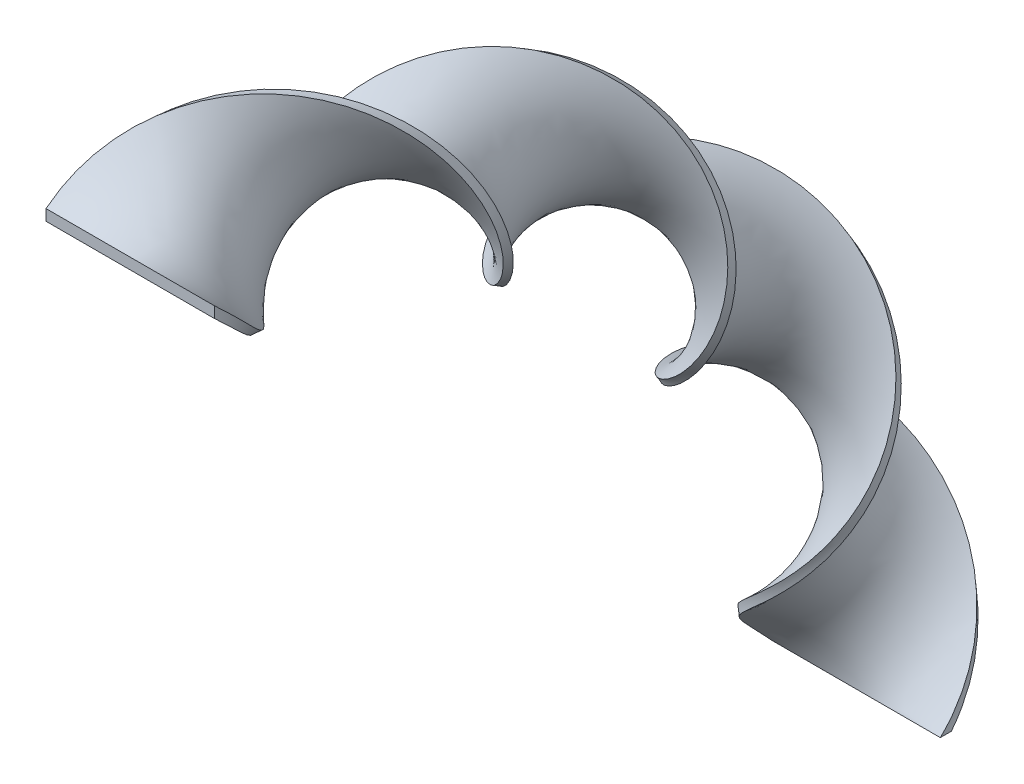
ISO-10303-21;
HEADER;
FILE_DESCRIPTION(('STEP AP214'),'2;1');
FILE_NAME('part.step','',(''),(''),'','','');
FILE_SCHEMA(('AUTOMOTIVE_DESIGN { 1 0 10303 214 1 1 1 1 }'));
ENDSEC;
DATA;
#1=APPLICATION_CONTEXT('core data for automotive mechanical design processes');
#2=APPLICATION_PROTOCOL_DEFINITION('international standard','automotive_design',2000,#1);
#3=PRODUCT_CONTEXT('',#1,'mechanical');
#4=PRODUCT('Part','Part','',(#3));
#5=PRODUCT_RELATED_PRODUCT_CATEGORY('part','',(#4));
#6=PRODUCT_DEFINITION_FORMATION('','',#4);
#7=PRODUCT_DEFINITION_CONTEXT('part definition',#1,'design');
#8=PRODUCT_DEFINITION('design','',#6,#7);
#9=PRODUCT_DEFINITION_SHAPE('','',#8);
#10=(LENGTH_UNIT() NAMED_UNIT(*) SI_UNIT(.MILLI.,.METRE.));
#11=(NAMED_UNIT(*) PLANE_ANGLE_UNIT() SI_UNIT($,.RADIAN.));
#12=(NAMED_UNIT(*) SI_UNIT($,.STERADIAN.) SOLID_ANGLE_UNIT());
#13=UNCERTAINTY_MEASURE_WITH_UNIT(LENGTH_MEASURE(1.E-05),#10,'distance_accuracy_value','');
#14=(GEOMETRIC_REPRESENTATION_CONTEXT(3) GLOBAL_UNCERTAINTY_ASSIGNED_CONTEXT((#13)) GLOBAL_UNIT_ASSIGNED_CONTEXT((#10,
#11,#12)) REPRESENTATION_CONTEXT('',''));
#15=CARTESIAN_POINT('',(0.,0.,0.));
#16=DIRECTION('',(0.,0.,1.));
#17=DIRECTION('',(1.,0.,0.));
#18=AXIS2_PLACEMENT_3D('',#15,#16,#17);
#19=CARTESIAN_POINT('',(-52.1268656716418,-3.41194029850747,0.));
#20=DIRECTION('',(0.,0.,1.));
#21=DIRECTION('',(1.,0.,0.));
#22=AXIS2_PLACEMENT_3D('',#19,#20,#21);
#23=PLANE('',#22);
#24=DIRECTION('',(0.,-1.,0.));
#25=VECTOR('',#24,1.);
#26=CARTESIAN_POINT('',(-52.1268656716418,3.41194029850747,0.));
#27=LINE('',#26,#25);
#28=CARTESIAN_POINT('',(-52.1268656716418,3.41194029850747,0.));
#29=VERTEX_POINT('',#28);
#30=CARTESIAN_POINT('',(-52.1268656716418,-3.41194029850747,0.));
#31=VERTEX_POINT('',#30);
#32=EDGE_CURVE('E83',#29,#31,#27,.T.);
#33=ORIENTED_EDGE('',*,*,#32,.T.);
#34=DIRECTION('',(1.,0.,0.));
#35=VECTOR('',#34,1.);
#36=CARTESIAN_POINT('',(-52.1268656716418,-3.41194029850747,0.));
#37=LINE('',#36,#35);
#38=CARTESIAN_POINT('',(52.1268656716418,-3.41194029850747,0.));
#39=VERTEX_POINT('',#38);
#40=EDGE_CURVE('E76',#31,#39,#37,.T.);
#41=ORIENTED_EDGE('',*,*,#40,.T.);
#42=DIRECTION('',(0.,1.,0.));
#43=VECTOR('',#42,1.);
#44=CARTESIAN_POINT('',(52.1268656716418,3.41194029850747,0.));
#45=LINE('',#44,#43);
#46=CARTESIAN_POINT('',(52.1268656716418,3.41194029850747,0.));
#47=VERTEX_POINT('',#46);
#48=EDGE_CURVE('E98',#39,#47,#45,.T.);
#49=ORIENTED_EDGE('',*,*,#48,.T.);
#50=DIRECTION('',(-1.,0.,0.));
#51=VECTOR('',#50,1.);
#52=CARTESIAN_POINT('',(-52.1268656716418,3.41194029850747,0.));
#53=LINE('',#52,#51);
#54=EDGE_CURVE('E96',#47,#29,#53,.T.);
#55=ORIENTED_EDGE('',*,*,#54,.T.);
#56=EDGE_LOOP('',(#33,#41,#49,#55));
#57=FACE_BOUND('',#56,.T.);
#58=ADVANCED_FACE('F31',(#57),#23,.T.);
#59=CARTESIAN_POINT('',(-52.1268656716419,-451.771342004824,-448.359401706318));
#60=DIRECTION('',(0.,1.,0.));
#61=DIRECTION('',(1.,0.,0.));
#62=AXIS2_PLACEMENT_3D('',#59,#60,#61);
#63=PLANE('',#62);
#64=DIRECTION('',(0.,0.,1.));
#65=VECTOR('',#64,1.);
#66=CARTESIAN_POINT('',(-52.1268656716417,-451.771342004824,-455.183282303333));
#67=LINE('',#66,#65);
#68=CARTESIAN_POINT('',(-52.1268656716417,-451.771342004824,-455.183282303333));
#69=VERTEX_POINT('',#68);
#70=CARTESIAN_POINT('',(-52.1268656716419,-451.771342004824,-448.359401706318));
#71=VERTEX_POINT('',#70);
#72=EDGE_CURVE('E108',#69,#71,#67,.T.);
#73=ORIENTED_EDGE('',*,*,#72,.F.);
#74=DIRECTION('',(-1.,0.,0.));
#75=VECTOR('',#74,1.);
#76=CARTESIAN_POINT('',(-52.1268656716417,-451.771342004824,-455.183282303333));
#77=LINE('',#76,#75);
#78=CARTESIAN_POINT('',(52.1268656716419,-451.771342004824,-455.18328230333));
#79=VERTEX_POINT('',#78);
#80=EDGE_CURVE('E11',#79,#69,#77,.T.);
#81=ORIENTED_EDGE('',*,*,#80,.F.);
#82=DIRECTION('',(0.,0.,-1.));
#83=VECTOR('',#82,1.);
#84=CARTESIAN_POINT('',(52.1268656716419,-451.771342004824,-455.18328230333));
#85=LINE('',#84,#83);
#86=CARTESIAN_POINT('',(52.1268656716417,-451.771342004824,-448.359401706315));
#87=VERTEX_POINT('',#86);
#88=EDGE_CURVE('E54',#87,#79,#85,.T.);
#89=ORIENTED_EDGE('',*,*,#88,.F.);
#90=DIRECTION('',(1.,0.,0.));
#91=VECTOR('',#90,1.);
#92=CARTESIAN_POINT('',(-52.1268656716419,-451.771342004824,-448.359401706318));
#93=LINE('',#92,#91);
#94=EDGE_CURVE('E135',#71,#87,#93,.T.);
#95=ORIENTED_EDGE('',*,*,#94,.F.);
#96=EDGE_LOOP('',(#73,#81,#89,#95));
#97=FACE_BOUND('',#96,.T.);
#98=ADVANCED_FACE('F181',(#97),#63,.F.);
#99=CARTESIAN_POINT('',(-52.1268656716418,3.41194029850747,0.));
#100=CARTESIAN_POINT('',(-51.6803014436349,10.2344493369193,-7.44704109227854));
#101=CARTESIAN_POINT('',(-49.8770747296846,16.7838736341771,-15.2392966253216));
#102=CARTESIAN_POINT('',(-43.8294277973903,28.2727277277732,-31.3626142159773));
#103=CARTESIAN_POINT('',(-39.5873293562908,33.2075400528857,-39.6928321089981));
#104=CARTESIAN_POINT('',(-29.3059787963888,40.6071513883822,-56.5687408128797));
#105=CARTESIAN_POINT('',(-23.2707719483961,43.0681232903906,-65.1114357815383));
#106=CARTESIAN_POINT('',(-10.3209601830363,45.0108783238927,-81.981937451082));
#107=CARTESIAN_POINT('',(-3.41145046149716,44.4911657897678,-90.3062057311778));
#108=CARTESIAN_POINT('',(10.2353310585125,40.3980400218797,-106.305121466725));
#109=CARTESIAN_POINT('',(16.9672334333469,36.825717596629,-113.976366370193));
#110=CARTESIAN_POINT('',(29.2333859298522,26.9944972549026,-128.335337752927));
#111=CARTESIAN_POINT('',(34.762809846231,20.7390216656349,-135.020717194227));
#112=CARTESIAN_POINT('',(43.7809227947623,6.28151914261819,-147.262550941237));
#113=CARTESIAN_POINT('',(47.2660635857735,-1.91536825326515,-152.818174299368));
#114=CARTESIAN_POINT('',(51.663211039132,-19.2739949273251,-162.892977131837));
#115=CARTESIAN_POINT('',(52.573487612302,-28.4298099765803,-167.413089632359));
#116=CARTESIAN_POINT('',(51.6802437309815,-46.6527251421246,-175.746339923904));
#117=CARTESIAN_POINT('',(49.8770747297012,-55.7141497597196,-179.561997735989));
#118=CARTESIAN_POINT('',(43.8294277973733,-72.8004559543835,-186.998902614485));
#119=CARTESIAN_POINT('',(39.5873293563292,-80.8209447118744,-190.623909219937));
#120=CARTESIAN_POINT('',(29.3059787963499,-95.1376210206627,-198.277904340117));
#121=CARTESIAN_POINT('',(23.2707719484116,-101.43141249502,-202.311112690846));
#122=CARTESIAN_POINT('',(10.3209601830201,-111.971365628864,-211.34290803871));
#123=CARTESIAN_POINT('',(3.41145046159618,-116.217489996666,-216.345325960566));
#124=CARTESIAN_POINT('',(-10.2353310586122,-122.740718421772,-227.715823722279));
#125=CARTESIAN_POINT('',(-16.9672334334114,-125.02004198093,-234.086493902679));
#126=CARTESIAN_POINT('',(-29.2333859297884,-128.056080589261,-248.332300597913));
#127=CARTESIAN_POINT('',(-34.762809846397,-128.816849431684,-256.208282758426));
#128=CARTESIAN_POINT('',(-43.7809227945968,-129.533142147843,-273.287675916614));
#129=CARTESIAN_POINT('',(-47.2660635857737,-129.493723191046,-282.489876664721));
#130=CARTESIAN_POINT('',(-51.6632110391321,-129.457873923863,-301.733530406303));
#131=CARTESIAN_POINT('',(-52.573487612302,-129.466548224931,-311.771845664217));
#132=CARTESIAN_POINT('',(-51.6802437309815,-130.349764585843,-331.954525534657));
#133=CARTESIAN_POINT('',(-49.8770747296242,-131.228486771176,-342.094291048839));
#134=CARTESIAN_POINT('',(-43.8294277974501,-134.50551694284,-361.619023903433));
#135=CARTESIAN_POINT('',(-39.5873293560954,-136.906436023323,-370.998825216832));
#136=CARTESIAN_POINT('',(-29.3059787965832,-143.607220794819,-388.164240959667));
#137=CARTESIAN_POINT('',(-23.27077194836,-147.907674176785,-395.945030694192));
#138=CARTESIAN_POINT('',(-10.320960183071,-158.463230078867,-409.248047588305));
#139=CARTESIAN_POINT('',(-3.41145046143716,-164.71688795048,-414.766714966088));
#140=CARTESIAN_POINT('',(10.2353310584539,-178.924106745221,-423.18537978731));
#141=CARTESIAN_POINT('',(16.967233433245,-186.874509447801,-426.083755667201));
#142=CARTESIAN_POINT('',(29.2333859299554,-203.979558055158,-429.285359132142));
#143=CARTESIAN_POINT('',(34.7628098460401,-213.13012440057,-429.58934706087));
#144=CARTESIAN_POINT('',(43.7809227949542,-232.009406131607,-428.022632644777));
#145=CARTESIAN_POINT('',(47.2660635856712,-241.733899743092,-426.15497693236));
#146=CARTESIAN_POINT('',(51.6632110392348,-261.132263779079,-421.004535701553));
#147=CARTESIAN_POINT('',(52.5734876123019,-270.802604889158,-417.726598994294));
#148=CARTESIAN_POINT('',(51.6802437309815,-289.58064956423,-410.733549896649));
#149=CARTESIAN_POINT('',(49.8770747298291,-298.686121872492,-407.024232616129));
#150=CARTESIAN_POINT('',(43.8294277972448,-316.026650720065,-400.201075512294));
#151=CARTESIAN_POINT('',(39.587329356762,-324.261259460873,-397.093000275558));
#152=CARTESIAN_POINT('',(29.3059787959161,-339.796870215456,-392.381773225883));
#153=CARTESIAN_POINT('',(23.2707719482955,-347.099161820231,-390.783299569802));
#154=CARTESIAN_POINT('',(10.3209601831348,-360.938477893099,-389.716870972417));
#155=CARTESIAN_POINT('',(3.41145046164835,-367.478184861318,-390.251651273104));
#156=CARTESIAN_POINT('',(-10.2353310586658,-380.130959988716,-393.679188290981));
#157=CARTESIAN_POINT('',(-16.9672334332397,-386.247411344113,-396.572203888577));
#158=CARTESIAN_POINT('',(-29.2333859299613,-398.467474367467,-404.498701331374));
#159=CARTESIAN_POINT('',(-34.7628098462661,-404.57455031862,-409.529914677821));
#160=CARTESIAN_POINT('',(-43.7809227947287,-417.157958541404,-421.100373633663));
#161=CARTESIAN_POINT('',(-47.266063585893,-423.637010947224,-427.635187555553));
#162=CARTESIAN_POINT('',(-51.6632110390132,-437.21900546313,-441.267860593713));
#163=CARTESIAN_POINT('',(-52.5736335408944,-444.320904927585,-448.357662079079));
#164=CARTESIAN_POINT('',(-52.1268656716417,-451.771342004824,-455.183282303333));
#165=CARTESIAN_POINT('',(-52.1268656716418,1.13731343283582,0.));
#166=CARTESIAN_POINT('',(-51.9780115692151,7.95979312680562,-7.40979511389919));
#167=CARTESIAN_POINT('',(-50.4724534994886,14.5694305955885,-15.1649344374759));
#168=CARTESIAN_POINT('',(-44.9749730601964,26.2892710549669,-31.2307458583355));
#169=CARTESIAN_POINT('',(-40.9851938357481,31.3947755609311,-39.5407346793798));
#170=CARTESIAN_POINT('',(-31.1249224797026,39.2185976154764,-56.4055350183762));
#171=CARTESIAN_POINT('',(-25.2583099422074,41.9328869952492,-64.9574378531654));
#172=CARTESIAN_POINT('',(-12.5363845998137,44.4240335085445,-81.8804884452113));
#173=CARTESIAN_POINT('',(-5.68607732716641,44.1991389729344,-90.2481179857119));
#174=CARTESIAN_POINT('',(7.96070419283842,40.6900668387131,-106.363209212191));
#175=CARTESIAN_POINT('',(14.7518090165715,37.4067143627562,-114.107215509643));
#176=CARTESIAN_POINT('',(27.2458479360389,28.1022512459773,-128.62749850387));
#177=CARTESIAN_POINT('',(32.9438661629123,22.0843341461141,-135.401311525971));
#178=CARTESIAN_POINT('',(42.38305831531,8.01450014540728,-147.815746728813));
#179=CARTESIAN_POINT('',(46.1205183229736,-0.0324296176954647,-153.455380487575));
#180=CARTESIAN_POINT('',(51.0678322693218,-17.1996593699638,-163.671706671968));
#181=CARTESIAN_POINT('',(52.2757396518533,-26.3140858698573,-168.249166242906));
#182=CARTESIAN_POINT('',(51.9779916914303,-44.5654868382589,-176.651187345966));
#183=CARTESIAN_POINT('',(50.4724534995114,-53.6967280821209,-180.478129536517));
#184=CARTESIAN_POINT('',(44.9749730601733,-71.0184444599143,-187.879768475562));
#185=CARTESIAN_POINT('',(40.9851938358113,-79.2043736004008,-191.458143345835));
#186=CARTESIAN_POINT('',(31.1249224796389,-93.9172206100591,-198.960063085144));
#187=CARTESIAN_POINT('',(25.2583099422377,-100.441523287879,-202.887824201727));
#188=CARTESIAN_POINT('',(12.5363845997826,-111.468014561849,-211.661210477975));
#189=CARTESIAN_POINT('',(5.68607732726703,-115.969921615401,-216.510745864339));
#190=CARTESIAN_POINT('',(-7.96070419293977,-122.988286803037,-227.550403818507));
#191=CARTESIAN_POINT('',(-14.751809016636,-125.506739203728,-233.743267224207));
#192=CARTESIAN_POINT('',(-27.2458479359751,-128.967706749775,-247.638460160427));
#193=CARTESIAN_POINT('',(-32.9438661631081,-129.914108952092,-255.341830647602));
#194=CARTESIAN_POINT('',(-42.3830583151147,-130.92250896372,-272.113406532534));
#195=CARTESIAN_POINT('',(-46.1205183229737,-130.989483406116,-281.180605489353));
#196=CARTESIAN_POINT('',(-51.067832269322,-131.076303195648,-300.220264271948));
#197=CARTESIAN_POINT('',(-52.2757396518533,-131.101269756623,-310.189759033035));
#198=CARTESIAN_POINT('',(-51.9779916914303,-131.931851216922,-330.319804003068));
#199=CARTESIAN_POINT('',(-50.4724534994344,-132.741752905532,-340.475861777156));
#200=CARTESIAN_POINT('',(-44.9749730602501,-135.814788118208,-360.12326368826));
#201=CARTESIAN_POINT('',(-40.9851938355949,-138.080705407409,-369.609458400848));
#202=CARTESIAN_POINT('',(-31.1249224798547,-144.473672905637,-387.066981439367));
#203=CARTESIAN_POINT('',(-25.2583099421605,-148.601514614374,-395.03340453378));
#204=CARTESIAN_POINT('',(-12.5363845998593,-158.806456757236,-408.761350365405));
#205=CARTESIAN_POINT('',(-5.68607732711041,-164.882307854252,-414.519146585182));
#206=CARTESIAN_POINT('',(7.96070419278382,-178.758686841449,-423.432948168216));
#207=CARTESIAN_POINT('',(14.7518090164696,-186.556207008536,-426.587106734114));
#208=CARTESIAN_POINT('',(27.2458479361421,-203.402846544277,-430.275248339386));
#209=CARTESIAN_POINT('',(32.9438661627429,-212.447965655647,-430.809747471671));
#210=CARTESIAN_POINT('',(42.3830583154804,-231.175172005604,-429.639203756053));
#211=CARTESIAN_POINT('',(46.1205183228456,-240.853033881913,-427.93698842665));
#212=CARTESIAN_POINT('',(51.0678322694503,-260.216131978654,-423.021957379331));
#213=CARTESIAN_POINT('',(52.2757396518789,-269.897757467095,-419.813837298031));
#214=CARTESIAN_POINT('',(51.9779916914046,-288.744572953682,-412.8492740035));
#215=CARTESIAN_POINT('',(50.4724534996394,-297.907392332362,-409.098568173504));
#216=CARTESIAN_POINT('',(44.9749730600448,-315.389444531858,-402.084014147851));
#217=CARTESIAN_POINT('',(40.9851938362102,-323.708063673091,-398.82598127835));
#218=CARTESIAN_POINT('',(31.124922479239,-339.416275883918,-393.727085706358));
#219=CARTESIAN_POINT('',(25.2583099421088,-346.807001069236,-391.891053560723));
#220=CARTESIAN_POINT('',(12.5363845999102,-360.807628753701,-390.297867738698));
#221=CARTESIAN_POINT('',(5.68607732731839,-367.420097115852,-390.543678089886));
#222=CARTESIAN_POINT('',(-7.96070419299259,-380.189047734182,-393.387161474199));
#223=CARTESIAN_POINT('',(-14.7518090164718,-386.348860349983,-395.985359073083));
#224=CARTESIAN_POINT('',(-27.2458479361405,-398.62147229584,-403.363465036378));
#225=CARTESIAN_POINT('',(-32.9438661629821,-404.737756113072,-408.141360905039));
#226=CARTESIAN_POINT('',(-42.3830583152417,-417.310055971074,-419.287609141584));
#227=CARTESIAN_POINT('',(-46.120518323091,-423.768879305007,-425.651730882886));
#228=CARTESIAN_POINT('',(-51.0678322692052,-437.293367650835,-439.053417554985));
#229=CARTESIAN_POINT('',(-52.2757882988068,-444.35813580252,-446.08303502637));
#230=CARTESIAN_POINT('',(-52.1268656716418,-451.771342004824,-452.908655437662));
#231=CARTESIAN_POINT('',(-52.1268656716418,-1.13731343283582,0.));
#232=CARTESIAN_POINT('',(-52.275719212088,5.68514050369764,-7.37255333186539));
#233=CARTESIAN_POINT('',(-51.0678322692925,12.3549875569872,-15.0905722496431));
#234=CARTESIAN_POINT('',(-46.1205183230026,24.3058143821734,-31.098877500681));
#235=CARTESIAN_POINT('',(-42.383058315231,29.5820110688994,-39.3886372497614));
#236=CARTESIAN_POINT('',(-32.9438661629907,37.8300438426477,-56.2423292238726));
#237=CARTESIAN_POINT('',(-27.2458479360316,40.7976507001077,-64.8034399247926));
#238=CARTESIAN_POINT('',(-14.7518090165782,43.8371886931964,-81.7790394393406));
#239=CARTESIAN_POINT('',(-7.96070419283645,43.9071121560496,-90.1900302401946));
#240=CARTESIAN_POINT('',(5.68607732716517,40.9820936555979,-106.421296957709));
#241=CARTESIAN_POINT('',(12.5363845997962,37.9877111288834,-114.238064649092));
#242=CARTESIAN_POINT('',(25.2583099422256,29.210005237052,-128.919659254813));
#243=CARTESIAN_POINT('',(31.1249224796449,23.4296466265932,-135.781905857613));
#244=CARTESIAN_POINT('',(40.9851938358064,9.74748114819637,-148.36894251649));
#245=CARTESIAN_POINT('',(44.9749730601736,1.85050901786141,-154.092586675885));
#246=CARTESIAN_POINT('',(50.4724534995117,-15.1253238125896,-164.450436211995));
#247=CARTESIAN_POINT('',(51.9779916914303,-24.1983617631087,-169.085242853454));
#248=CARTESIAN_POINT('',(52.2757396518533,-42.4782485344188,-177.556034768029));
#249=CARTESIAN_POINT('',(51.0678322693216,-51.6793064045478,-181.394261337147));
#250=CARTESIAN_POINT('',(46.1205183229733,-69.2364329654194,-188.760634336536));
#251=CARTESIAN_POINT('',(42.3830583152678,-77.587802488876,-192.292377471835));
#252=CARTESIAN_POINT('',(32.9438661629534,-92.6968201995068,-199.64222183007));
#253=CARTESIAN_POINT('',(27.245847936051,-99.4516340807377,-203.464535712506));
#254=CARTESIAN_POINT('',(14.751809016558,-110.964663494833,-211.979512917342));
#255=CARTESIAN_POINT('',(7.96070419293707,-115.722353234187,-216.676165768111));
#256=CARTESIAN_POINT('',(-5.68607732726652,-123.235855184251,-227.384983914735));
#257=CARTESIAN_POINT('',(-12.5363845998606,-125.993436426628,-233.400040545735));
#258=CARTESIAN_POINT('',(-25.2583099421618,-129.879332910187,-246.94461972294));
#259=CARTESIAN_POINT('',(-31.1249224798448,-131.011368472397,-254.475378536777));
#260=CARTESIAN_POINT('',(-40.9851938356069,-132.311875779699,-270.939137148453));
#261=CARTESIAN_POINT('',(-44.9749730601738,-132.485243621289,-279.87133431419));
#262=CARTESIAN_POINT('',(-50.4724534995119,-132.694732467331,-298.706998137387));
#263=CARTESIAN_POINT('',(-51.9779916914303,-132.735991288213,-308.607672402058));
#264=CARTESIAN_POINT('',(-52.2757396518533,-133.513937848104,-328.685082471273));
#265=CARTESIAN_POINT('',(-51.0678322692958,-134.255019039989,-338.857432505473));
#266=CARTESIAN_POINT('',(-46.1205183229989,-137.124059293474,-358.627503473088));
#267=CARTESIAN_POINT('',(-42.3830583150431,-139.254974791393,-368.220091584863));
#268=CARTESIAN_POINT('',(-32.9438661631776,-145.340125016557,-385.969721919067));
#269=CARTESIAN_POINT('',(-27.2458479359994,-149.29535505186,-394.121778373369));
#270=CARTESIAN_POINT('',(-14.751809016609,-159.149683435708,-408.274653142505));
#271=CARTESIAN_POINT('',(-7.96070419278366,-165.047727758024,-414.271578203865));
#272=CARTESIAN_POINT('',(5.68607732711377,-178.593266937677,-423.680516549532));
#273=CARTESIAN_POINT('',(12.5363845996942,-186.237904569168,-427.090457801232));
#274=CARTESIAN_POINT('',(25.2583099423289,-202.826135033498,-431.265137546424));
#275=CARTESIAN_POINT('',(31.1249224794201,-211.765806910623,-432.030147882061));
#276=CARTESIAN_POINT('',(40.9851938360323,-230.340937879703,-431.255774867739));
#277=CARTESIAN_POINT('',(44.9749730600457,-239.972168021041,-429.718999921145));
#278=CARTESIAN_POINT('',(50.4724534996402,-259.300000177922,-425.039379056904));
#279=CARTESIAN_POINT('',(51.9779916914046,-268.992910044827,-421.901075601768));
#280=CARTESIAN_POINT('',(52.275739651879,-287.908496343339,-414.964998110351));
#281=CARTESIAN_POINT('',(51.0678322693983,-297.128662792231,-411.172903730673));
#282=CARTESIAN_POINT('',(46.1205183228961,-314.75223834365,-403.966952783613));
#283=CARTESIAN_POINT('',(42.3830583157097,-323.154867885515,-400.558962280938));
#284=CARTESIAN_POINT('',(32.9438661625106,-339.035681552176,-395.072398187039));
#285=CARTESIAN_POINT('',(27.2458479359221,-346.514840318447,-392.998807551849));
#286=CARTESIAN_POINT('',(14.7518090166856,-360.676779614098,-390.878864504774));
#287=CARTESIAN_POINT('',(7.96070419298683,-367.362009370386,-390.835704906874));
#288=CARTESIAN_POINT('',(-5.68607732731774,-380.247135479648,-393.095134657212));
#289=CARTESIAN_POINT('',(-12.536384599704,-386.450309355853,-395.398514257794));
#290=CARTESIAN_POINT('',(-25.2583099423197,-398.775470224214,-402.228228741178));
#291=CARTESIAN_POINT('',(-31.1249224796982,-404.900961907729,-406.752807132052));
#292=CARTESIAN_POINT('',(-40.9851938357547,-417.462153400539,-417.474844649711));
#293=CARTESIAN_POINT('',(-44.9749730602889,-423.900747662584,-423.668274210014));
#294=CARTESIAN_POINT('',(-50.4724534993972,-437.367729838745,-436.838974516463));
#295=CARTESIAN_POINT('',(-51.9779430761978,-444.395368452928,-443.808409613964));
#296=CARTESIAN_POINT('',(-52.1268656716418,-451.771342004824,-450.63402857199));
#297=CARTESIAN_POINT('',(-52.1268656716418,-3.41194029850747,0.));
#298=CARTESIAN_POINT('',(-52.5734248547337,3.41049166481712,-7.33531589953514));
#299=CARTESIAN_POINT('',(-51.6632110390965,10.1405445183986,-15.0162100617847));
#300=CARTESIAN_POINT('',(-47.2660635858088,22.322357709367,-30.967009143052));
#301=CARTESIAN_POINT('',(-43.7809227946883,27.7692465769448,-39.2365398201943));
#302=CARTESIAN_POINT('',(-34.7628098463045,36.441490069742,-56.0791234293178));
#303=CARTESIAN_POINT('',(-29.2333859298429,39.6624144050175,-64.6494419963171));
#304=CARTESIAN_POINT('',(-16.9672334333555,43.250343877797,-81.6775904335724));
#305=CARTESIAN_POINT('',(-10.2353310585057,43.6150853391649,-90.1319424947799));
#306=CARTESIAN_POINT('',(3.41145046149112,41.2741204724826,-106.479384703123));
#307=CARTESIAN_POINT('',(10.3209601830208,38.5687078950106,-114.368913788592));
#308=CARTESIAN_POINT('',(23.2707719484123,30.3177592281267,-129.211820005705));
#309=CARTESIAN_POINT('',(29.3059787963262,24.7749591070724,-136.162500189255));
#310=CARTESIAN_POINT('',(39.587329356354,11.4804621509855,-148.922138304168));
#311=CARTESIAN_POINT('',(43.8294277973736,3.7334476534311,-154.729792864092));
#312=CARTESIAN_POINT('',(49.8770747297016,-13.0509882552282,-165.229165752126));
#313=CARTESIAN_POINT('',(51.6802437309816,-22.0826376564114,-169.921319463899));
#314=CARTESIAN_POINT('',(52.573487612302,-40.3910102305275,-178.460882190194));
#315=CARTESIAN_POINT('',(51.6632110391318,-49.6618847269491,-182.310393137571));
#316=CARTESIAN_POINT('',(47.2660635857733,-67.4544214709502,-189.641500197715));
#317=CARTESIAN_POINT('',(43.7809227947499,-75.9712313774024,-193.126611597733));
#318=CARTESIAN_POINT('',(34.7628098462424,-91.4764197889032,-200.324380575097));
#319=CARTESIAN_POINT('',(29.2333859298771,-98.4617448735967,-204.041247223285));
#320=CARTESIAN_POINT('',(16.9672334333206,-110.461312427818,-212.29781535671));
#321=CARTESIAN_POINT('',(10.2353310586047,-115.474784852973,-216.841585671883));
#322=CARTESIAN_POINT('',(-3.41145046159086,-123.483423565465,-227.219564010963));
#323=CARTESIAN_POINT('',(-10.3209601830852,-126.480133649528,-233.056813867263));
#324=CARTESIAN_POINT('',(-23.2707719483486,-130.790959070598,-246.250779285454));
#325=CARTESIAN_POINT('',(-29.3059787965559,-132.108627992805,-253.608926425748));
#326=CARTESIAN_POINT('',(-39.5873293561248,-133.701242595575,-269.764867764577));
#327=CARTESIAN_POINT('',(-43.8294277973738,-133.981003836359,-278.562063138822));
#328=CARTESIAN_POINT('',(-49.8770747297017,-134.313161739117,-297.193732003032));
#329=CARTESIAN_POINT('',(-51.6802437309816,-134.370712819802,-307.025585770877));
#330=CARTESIAN_POINT('',(-52.5734876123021,-135.096024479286,-327.050360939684));
#331=CARTESIAN_POINT('',(-51.663211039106,-135.768285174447,-337.239003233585));
#332=CARTESIAN_POINT('',(-47.2660635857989,-138.433330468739,-357.13174325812));
#333=CARTESIAN_POINT('',(-43.7809227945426,-140.42924417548,-366.830724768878));
#334=CARTESIAN_POINT('',(-34.7628098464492,-146.206577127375,-384.872462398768));
#335=CARTESIAN_POINT('',(-29.2333859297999,-149.989195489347,-393.210152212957));
#336=CARTESIAN_POINT('',(-16.9672334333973,-159.49291011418,-407.787955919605));
#337=CARTESIAN_POINT('',(-10.2353310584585,-165.213147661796,-414.024009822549));
#338=CARTESIAN_POINT('',(3.41145046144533,-178.427847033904,-423.928084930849));
#339=CARTESIAN_POINT('',(10.3209601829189,-185.919602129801,-427.59380886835));
#340=CARTESIAN_POINT('',(23.2707719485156,-202.24942352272,-432.255026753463));
#341=CARTESIAN_POINT('',(29.3059787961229,-211.0836481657,-433.250548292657));
#342=CARTESIAN_POINT('',(39.5873293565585,-229.5067037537,-432.872345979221));
#343=CARTESIAN_POINT('',(43.8294277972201,-239.091302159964,-431.50101141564));
#344=CARTESIAN_POINT('',(49.8770747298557,-258.383868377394,-427.056800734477));
#345=CARTESIAN_POINT('',(51.6802437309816,-268.088062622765,-423.988313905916));
#346=CARTESIAN_POINT('',(52.5734876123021,-287.072419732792,-417.080722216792));
#347=CARTESIAN_POINT('',(51.6632110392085,-296.349933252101,-413.247239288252));
#348=CARTESIAN_POINT('',(47.2660635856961,-314.115032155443,-405.849891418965));
#349=CARTESIAN_POINT('',(43.7809227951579,-322.601672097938,-402.291943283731));
#350=CARTESIAN_POINT('',(34.7628098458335,-338.655087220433,-396.417710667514));
#351=CARTESIAN_POINT('',(29.2333859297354,-346.222679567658,-394.106561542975));
#352=CARTESIAN_POINT('',(16.967233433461,-360.545930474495,-391.45986127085));
#353=CARTESIAN_POINT('',(10.2353310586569,-367.30392162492,-391.127731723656));
#354=CARTESIAN_POINT('',(-3.41145046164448,-380.305223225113,-392.803107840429));
#355=CARTESIAN_POINT('',(-10.3209601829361,-386.551758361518,-394.811669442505));
#356=CARTESIAN_POINT('',(-23.2707719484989,-398.929468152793,-401.092992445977));
#357=CARTESIAN_POINT('',(-29.3059787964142,-405.064167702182,-405.36425335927));
#358=CARTESIAN_POINT('',(-39.5873293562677,-417.614250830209,-415.662080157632));
#359=CARTESIAN_POINT('',(-43.8294277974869,-424.032616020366,-421.684817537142));
#360=CARTESIAN_POINT('',(-49.8770747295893,-437.44209202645,-434.62453147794));
#361=CARTESIAN_POINT('',(-51.680098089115,-444.432602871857,-441.533785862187));
#362=CARTESIAN_POINT('',(-52.1268656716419,-451.771342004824,-448.359401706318));
#363=B_SPLINE_SURFACE_WITH_KNOTS('',3,3,((#99,#100,#101,#102,#103,#104,#105,#106,#107,#108,#109,
#110,#111,#112,#113,#114,#115,#116,#117,#118,#119,#120,#121,#122,#123,#124,#125,#126,#127,#128,
#129,#130,#131,#132,#133,#134,#135,#136,#137,#138,#139,#140,#141,#142,#143,#144,#145,#146,#147,
#148,#149,#150,#151,#152,#153,#154,#155,#156,#157,#158,#159,#160,#161,#162,#163,#164),(#165,
#166,#167,#168,#169,#170,#171,#172,#173,#174,#175,#176,#177,#178,#179,#180,#181,#182,#183,#184,
#185,#186,#187,#188,#189,#190,#191,#192,#193,#194,#195,#196,#197,#198,#199,#200,#201,#202,#203,
#204,#205,#206,#207,#208,#209,#210,#211,#212,#213,#214,#215,#216,#217,#218,#219,#220,#221,#222,
#223,#224,#225,#226,#227,#228,#229,#230),(#231,#232,#233,#234,#235,#236,#237,#238,#239,#240,
#241,#242,#243,#244,#245,#246,#247,#248,#249,#250,#251,#252,#253,#254,#255,#256,#257,#258,#259,
#260,#261,#262,#263,#264,#265,#266,#267,#268,#269,#270,#271,#272,#273,#274,#275,#276,#277,#278,
#279,#280,#281,#282,#283,#284,#285,#286,#287,#288,#289,#290,#291,#292,#293,#294,#295,#296),
(#297,#298,#299,#300,#301,#302,#303,#304,#305,#306,#307,#308,#309,#310,#311,#312,#313,#314,#315,
#316,#317,#318,#319,#320,#321,#322,#323,#324,#325,#326,#327,#328,#329,#330,#331,#332,#333,#334,
#335,#336,#337,#338,#339,#340,#341,#342,#343,#344,#345,#346,#347,#348,#349,#350,#351,#352,#353,
#354,#355,#356,#357,#358,#359,#360,#361,#362)),.UNSPECIFIED.,.F.,.F.,.F.,(4,4),(4,2,2,2,2,2,2,2,
2,2,2,2,2,2,2,2,2,2,2,2,2,2,2,2,2,2,2,2,2,2,2,2,4),(0.,1.),(0.,0.03125,0.0625,0.09375,0.125,
0.15625,0.1875,0.21875,0.25,0.28125,0.3125,0.34375,0.375,0.40625,0.4375,0.46875,0.5,0.53125,
0.5625,0.59375,0.625,0.65625,0.6875,0.71875,0.75,0.78125,0.8125,0.84375,0.875,0.90625,0.9375,
0.96875,1.),.UNSPECIFIED.);
#364=CARTESIAN_POINT('',(-52.1268656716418,-3.41194029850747,0.));
#365=CARTESIAN_POINT('',(-52.5734248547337,3.41049166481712,-7.33531589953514));
#366=CARTESIAN_POINT('',(-51.6632110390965,10.1405445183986,-15.0162100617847));
#367=CARTESIAN_POINT('',(-47.2660635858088,22.322357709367,-30.967009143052));
#368=CARTESIAN_POINT('',(-43.7809227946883,27.7692465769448,-39.2365398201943));
#369=CARTESIAN_POINT('',(-34.7628098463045,36.441490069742,-56.0791234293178));
#370=CARTESIAN_POINT('',(-29.2333859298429,39.6624144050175,-64.6494419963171));
#371=CARTESIAN_POINT('',(-16.9672334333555,43.250343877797,-81.6775904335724));
#372=CARTESIAN_POINT('',(-10.2353310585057,43.6150853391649,-90.1319424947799));
#373=CARTESIAN_POINT('',(3.41145046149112,41.2741204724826,-106.479384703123));
#374=CARTESIAN_POINT('',(10.3209601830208,38.5687078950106,-114.368913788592));
#375=CARTESIAN_POINT('',(23.2707719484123,30.3177592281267,-129.211820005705));
#376=CARTESIAN_POINT('',(29.3059787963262,24.7749591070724,-136.162500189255));
#377=CARTESIAN_POINT('',(39.587329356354,11.4804621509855,-148.922138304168));
#378=CARTESIAN_POINT('',(43.8294277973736,3.7334476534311,-154.729792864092));
#379=CARTESIAN_POINT('',(49.8770747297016,-13.0509882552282,-165.229165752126));
#380=CARTESIAN_POINT('',(51.6802437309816,-22.0826376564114,-169.921319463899));
#381=CARTESIAN_POINT('',(52.573487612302,-40.3910102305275,-178.460882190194));
#382=CARTESIAN_POINT('',(51.6632110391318,-49.6618847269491,-182.310393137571));
#383=CARTESIAN_POINT('',(47.2660635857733,-67.4544214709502,-189.641500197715));
#384=CARTESIAN_POINT('',(43.7809227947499,-75.9712313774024,-193.126611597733));
#385=CARTESIAN_POINT('',(34.7628098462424,-91.4764197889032,-200.324380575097));
#386=CARTESIAN_POINT('',(29.2333859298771,-98.4617448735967,-204.041247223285));
#387=CARTESIAN_POINT('',(16.9672334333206,-110.461312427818,-212.29781535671));
#388=CARTESIAN_POINT('',(10.2353310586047,-115.474784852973,-216.841585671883));
#389=CARTESIAN_POINT('',(-3.41145046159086,-123.483423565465,-227.219564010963));
#390=CARTESIAN_POINT('',(-10.3209601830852,-126.480133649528,-233.056813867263));
#391=CARTESIAN_POINT('',(-23.2707719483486,-130.790959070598,-246.250779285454));
#392=CARTESIAN_POINT('',(-29.3059787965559,-132.108627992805,-253.608926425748));
#393=CARTESIAN_POINT('',(-39.5873293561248,-133.701242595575,-269.764867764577));
#394=CARTESIAN_POINT('',(-43.8294277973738,-133.981003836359,-278.562063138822));
#395=CARTESIAN_POINT('',(-49.8770747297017,-134.313161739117,-297.193732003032));
#396=CARTESIAN_POINT('',(-51.6802437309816,-134.370712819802,-307.025585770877));
#397=CARTESIAN_POINT('',(-52.5734876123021,-135.096024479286,-327.050360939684));
#398=CARTESIAN_POINT('',(-51.663211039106,-135.768285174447,-337.239003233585));
#399=CARTESIAN_POINT('',(-47.2660635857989,-138.433330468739,-357.13174325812));
#400=CARTESIAN_POINT('',(-43.7809227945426,-140.42924417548,-366.830724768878));
#401=CARTESIAN_POINT('',(-34.7628098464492,-146.206577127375,-384.872462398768));
#402=CARTESIAN_POINT('',(-29.2333859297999,-149.989195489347,-393.210152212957));
#403=CARTESIAN_POINT('',(-16.9672334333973,-159.49291011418,-407.787955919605));
#404=CARTESIAN_POINT('',(-10.2353310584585,-165.213147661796,-414.024009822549));
#405=CARTESIAN_POINT('',(3.41145046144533,-178.427847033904,-423.928084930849));
#406=CARTESIAN_POINT('',(10.3209601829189,-185.919602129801,-427.59380886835));
#407=CARTESIAN_POINT('',(23.2707719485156,-202.24942352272,-432.255026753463));
#408=CARTESIAN_POINT('',(29.3059787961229,-211.0836481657,-433.250548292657));
#409=CARTESIAN_POINT('',(39.5873293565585,-229.5067037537,-432.872345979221));
#410=CARTESIAN_POINT('',(43.8294277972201,-239.091302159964,-431.50101141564));
#411=CARTESIAN_POINT('',(49.8770747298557,-258.383868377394,-427.056800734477));
#412=CARTESIAN_POINT('',(51.6802437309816,-268.088062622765,-423.988313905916));
#413=CARTESIAN_POINT('',(52.5734876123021,-287.072419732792,-417.080722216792));
#414=CARTESIAN_POINT('',(51.6632110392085,-296.349933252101,-413.247239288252));
#415=CARTESIAN_POINT('',(47.2660635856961,-314.115032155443,-405.849891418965));
#416=CARTESIAN_POINT('',(43.7809227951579,-322.601672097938,-402.291943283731));
#417=CARTESIAN_POINT('',(34.7628098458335,-338.655087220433,-396.417710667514));
#418=CARTESIAN_POINT('',(29.2333859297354,-346.222679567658,-394.106561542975));
#419=CARTESIAN_POINT('',(16.967233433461,-360.545930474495,-391.45986127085));
#420=CARTESIAN_POINT('',(10.2353310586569,-367.30392162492,-391.127731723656));
#421=CARTESIAN_POINT('',(-3.41145046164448,-380.305223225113,-392.803107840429));
#422=CARTESIAN_POINT('',(-10.3209601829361,-386.551758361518,-394.811669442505));
#423=CARTESIAN_POINT('',(-23.2707719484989,-398.929468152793,-401.092992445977));
#424=CARTESIAN_POINT('',(-29.3059787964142,-405.064167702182,-405.36425335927));
#425=CARTESIAN_POINT('',(-39.5873293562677,-417.614250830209,-415.662080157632));
#426=CARTESIAN_POINT('',(-43.8294277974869,-424.032616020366,-421.684817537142));
#427=CARTESIAN_POINT('',(-49.8770747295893,-437.44209202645,-434.62453147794));
#428=CARTESIAN_POINT('',(-51.680098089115,-444.432602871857,-441.533785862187));
#429=CARTESIAN_POINT('',(-52.1268656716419,-451.771342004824,-448.359401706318));
#430=B_SPLINE_CURVE_WITH_KNOTS('',3,(#364,#365,#366,#367,#368,#369,#370,#371,#372,#373,#374,
#375,#376,#377,#378,#379,#380,#381,#382,#383,#384,#385,#386,#387,#388,#389,#390,#391,#392,#393,
#394,#395,#396,#397,#398,#399,#400,#401,#402,#403,#404,#405,#406,#407,#408,#409,#410,#411,#412,
#413,#414,#415,#416,#417,#418,#419,#420,#421,#422,#423,#424,#425,#426,#427,#428,#429),
.UNSPECIFIED.,.F.,.F.,(4,2,2,2,2,2,2,2,2,2,2,2,2,2,2,2,2,2,2,2,2,2,2,2,2,2,2,2,2,2,2,2,4),(0.,
0.03125,0.0625,0.09375,0.125,0.15625,0.1875,0.21875,0.25,0.28125,0.3125,0.34375,0.375,0.40625,
0.4375,0.46875,0.5,0.53125,0.5625,0.59375,0.625,0.65625,0.6875,0.71875,0.75,0.78125,0.8125,
0.84375,0.875,0.90625,0.9375,0.96875,1.),.UNSPECIFIED.);
#431=EDGE_CURVE('E89',#31,#71,#430,.T.);
#432=CARTESIAN_POINT('',(-52.1268656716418,3.41194029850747,0.));
#433=CARTESIAN_POINT('',(-51.6803014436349,10.2344493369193,-7.44704109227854));
#434=CARTESIAN_POINT('',(-49.8770747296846,16.7838736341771,-15.2392966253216));
#435=CARTESIAN_POINT('',(-43.8294277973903,28.2727277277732,-31.3626142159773));
#436=CARTESIAN_POINT('',(-39.5873293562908,33.2075400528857,-39.6928321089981));
#437=CARTESIAN_POINT('',(-29.3059787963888,40.6071513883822,-56.5687408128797));
#438=CARTESIAN_POINT('',(-23.2707719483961,43.0681232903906,-65.1114357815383));
#439=CARTESIAN_POINT('',(-10.3209601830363,45.0108783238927,-81.981937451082));
#440=CARTESIAN_POINT('',(-3.41145046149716,44.4911657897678,-90.3062057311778));
#441=CARTESIAN_POINT('',(10.2353310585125,40.3980400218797,-106.305121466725));
#442=CARTESIAN_POINT('',(16.9672334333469,36.825717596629,-113.976366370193));
#443=CARTESIAN_POINT('',(29.2333859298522,26.9944972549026,-128.335337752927));
#444=CARTESIAN_POINT('',(34.762809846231,20.7390216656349,-135.020717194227));
#445=CARTESIAN_POINT('',(43.7809227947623,6.28151914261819,-147.262550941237));
#446=CARTESIAN_POINT('',(47.2660635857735,-1.91536825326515,-152.818174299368));
#447=CARTESIAN_POINT('',(51.663211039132,-19.2739949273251,-162.892977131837));
#448=CARTESIAN_POINT('',(52.573487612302,-28.4298099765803,-167.413089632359));
#449=CARTESIAN_POINT('',(51.6802437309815,-46.6527251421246,-175.746339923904));
#450=CARTESIAN_POINT('',(49.8770747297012,-55.7141497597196,-179.561997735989));
#451=CARTESIAN_POINT('',(43.8294277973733,-72.8004559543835,-186.998902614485));
#452=CARTESIAN_POINT('',(39.5873293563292,-80.8209447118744,-190.623909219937));
#453=CARTESIAN_POINT('',(29.3059787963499,-95.1376210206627,-198.277904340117));
#454=CARTESIAN_POINT('',(23.2707719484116,-101.43141249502,-202.311112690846));
#455=CARTESIAN_POINT('',(10.3209601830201,-111.971365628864,-211.34290803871));
#456=CARTESIAN_POINT('',(3.41145046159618,-116.217489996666,-216.345325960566));
#457=CARTESIAN_POINT('',(-10.2353310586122,-122.740718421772,-227.715823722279));
#458=CARTESIAN_POINT('',(-16.9672334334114,-125.02004198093,-234.086493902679));
#459=CARTESIAN_POINT('',(-29.2333859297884,-128.056080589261,-248.332300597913));
#460=CARTESIAN_POINT('',(-34.762809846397,-128.816849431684,-256.208282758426));
#461=CARTESIAN_POINT('',(-43.7809227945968,-129.533142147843,-273.287675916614));
#462=CARTESIAN_POINT('',(-47.2660635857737,-129.493723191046,-282.489876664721));
#463=CARTESIAN_POINT('',(-51.6632110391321,-129.457873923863,-301.733530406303));
#464=CARTESIAN_POINT('',(-52.573487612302,-129.466548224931,-311.771845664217));
#465=CARTESIAN_POINT('',(-51.6802437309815,-130.349764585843,-331.954525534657));
#466=CARTESIAN_POINT('',(-49.8770747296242,-131.228486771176,-342.094291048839));
#467=CARTESIAN_POINT('',(-43.8294277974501,-134.50551694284,-361.619023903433));
#468=CARTESIAN_POINT('',(-39.5873293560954,-136.906436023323,-370.998825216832));
#469=CARTESIAN_POINT('',(-29.3059787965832,-143.607220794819,-388.164240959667));
#470=CARTESIAN_POINT('',(-23.27077194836,-147.907674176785,-395.945030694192));
#471=CARTESIAN_POINT('',(-10.320960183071,-158.463230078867,-409.248047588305));
#472=CARTESIAN_POINT('',(-3.41145046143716,-164.71688795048,-414.766714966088));
#473=CARTESIAN_POINT('',(10.2353310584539,-178.924106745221,-423.18537978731));
#474=CARTESIAN_POINT('',(16.967233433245,-186.874509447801,-426.083755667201));
#475=CARTESIAN_POINT('',(29.2333859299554,-203.979558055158,-429.285359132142));
#476=CARTESIAN_POINT('',(34.7628098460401,-213.13012440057,-429.58934706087));
#477=CARTESIAN_POINT('',(43.7809227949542,-232.009406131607,-428.022632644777));
#478=CARTESIAN_POINT('',(47.2660635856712,-241.733899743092,-426.15497693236));
#479=CARTESIAN_POINT('',(51.6632110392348,-261.132263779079,-421.004535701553));
#480=CARTESIAN_POINT('',(52.5734876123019,-270.802604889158,-417.726598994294));
#481=CARTESIAN_POINT('',(51.6802437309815,-289.58064956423,-410.733549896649));
#482=CARTESIAN_POINT('',(49.8770747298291,-298.686121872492,-407.024232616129));
#483=CARTESIAN_POINT('',(43.8294277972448,-316.026650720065,-400.201075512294));
#484=CARTESIAN_POINT('',(39.587329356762,-324.261259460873,-397.093000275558));
#485=CARTESIAN_POINT('',(29.3059787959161,-339.796870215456,-392.381773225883));
#486=CARTESIAN_POINT('',(23.2707719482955,-347.099161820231,-390.783299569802));
#487=CARTESIAN_POINT('',(10.3209601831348,-360.938477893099,-389.716870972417));
#488=CARTESIAN_POINT('',(3.41145046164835,-367.478184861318,-390.251651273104));
#489=CARTESIAN_POINT('',(-10.2353310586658,-380.130959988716,-393.679188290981));
#490=CARTESIAN_POINT('',(-16.9672334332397,-386.247411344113,-396.572203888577));
#491=CARTESIAN_POINT('',(-29.2333859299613,-398.467474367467,-404.498701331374));
#492=CARTESIAN_POINT('',(-34.7628098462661,-404.57455031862,-409.529914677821));
#493=CARTESIAN_POINT('',(-43.7809227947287,-417.157958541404,-421.100373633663));
#494=CARTESIAN_POINT('',(-47.266063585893,-423.637010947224,-427.635187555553));
#495=CARTESIAN_POINT('',(-51.6632110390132,-437.21900546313,-441.267860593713));
#496=CARTESIAN_POINT('',(-52.5736335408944,-444.320904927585,-448.357662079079));
#497=CARTESIAN_POINT('',(-52.1268656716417,-451.771342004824,-455.183282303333));
#498=B_SPLINE_CURVE_WITH_KNOTS('',3,(#432,#433,#434,#435,#436,#437,#438,#439,#440,#441,#442,
#443,#444,#445,#446,#447,#448,#449,#450,#451,#452,#453,#454,#455,#456,#457,#458,#459,#460,#461,
#462,#463,#464,#465,#466,#467,#468,#469,#470,#471,#472,#473,#474,#475,#476,#477,#478,#479,#480,
#481,#482,#483,#484,#485,#486,#487,#488,#489,#490,#491,#492,#493,#494,#495,#496,#497),
.UNSPECIFIED.,.F.,.F.,(4,2,2,2,2,2,2,2,2,2,2,2,2,2,2,2,2,2,2,2,2,2,2,2,2,2,2,2,2,2,2,2,4),(0.,
0.03125,0.0625,0.09375,0.125,0.15625,0.1875,0.21875,0.25,0.28125,0.3125,0.34375,0.375,0.40625,
0.4375,0.46875,0.5,0.53125,0.5625,0.59375,0.625,0.65625,0.6875,0.71875,0.75,0.78125,0.8125,
0.84375,0.875,0.90625,0.9375,0.96875,1.),.UNSPECIFIED.);
#499=EDGE_CURVE('E38',#29,#69,#498,.T.);
#500=ORIENTED_EDGE('',*,*,#431,.F.);
#501=ORIENTED_EDGE('',*,*,#32,.F.);
#502=ORIENTED_EDGE('',*,*,#499,.T.);
#503=ORIENTED_EDGE('',*,*,#72,.T.);
#504=EDGE_LOOP('',(#500,#501,#502,#503));
#505=FACE_BOUND('',#504,.T.);
#506=ADVANCED_FACE('F86',(#505),#363,.F.);
#507=CARTESIAN_POINT('',(-52.1268656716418,-3.41194029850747,0.));
#508=CARTESIAN_POINT('',(-52.5734248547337,3.41049166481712,-7.33531589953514));
#509=CARTESIAN_POINT('',(-51.6632110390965,10.1405445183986,-15.0162100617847));
#510=CARTESIAN_POINT('',(-47.2660635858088,22.322357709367,-30.967009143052));
#511=CARTESIAN_POINT('',(-43.7809227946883,27.7692465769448,-39.2365398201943));
#512=CARTESIAN_POINT('',(-34.7628098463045,36.441490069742,-56.0791234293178));
#513=CARTESIAN_POINT('',(-29.2333859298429,39.6624144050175,-64.6494419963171));
#514=CARTESIAN_POINT('',(-16.9672334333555,43.250343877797,-81.6775904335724));
#515=CARTESIAN_POINT('',(-10.2353310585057,43.6150853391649,-90.1319424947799));
#516=CARTESIAN_POINT('',(3.41145046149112,41.2741204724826,-106.479384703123));
#517=CARTESIAN_POINT('',(10.3209601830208,38.5687078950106,-114.368913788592));
#518=CARTESIAN_POINT('',(23.2707719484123,30.3177592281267,-129.211820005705));
#519=CARTESIAN_POINT('',(29.3059787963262,24.7749591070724,-136.162500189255));
#520=CARTESIAN_POINT('',(39.587329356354,11.4804621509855,-148.922138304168));
#521=CARTESIAN_POINT('',(43.8294277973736,3.7334476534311,-154.729792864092));
#522=CARTESIAN_POINT('',(49.8770747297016,-13.0509882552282,-165.229165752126));
#523=CARTESIAN_POINT('',(51.6802437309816,-22.0826376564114,-169.921319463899));
#524=CARTESIAN_POINT('',(52.573487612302,-40.3910102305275,-178.460882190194));
#525=CARTESIAN_POINT('',(51.6632110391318,-49.6618847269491,-182.310393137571));
#526=CARTESIAN_POINT('',(47.2660635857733,-67.4544214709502,-189.641500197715));
#527=CARTESIAN_POINT('',(43.7809227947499,-75.9712313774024,-193.126611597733));
#528=CARTESIAN_POINT('',(34.7628098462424,-91.4764197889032,-200.324380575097));
#529=CARTESIAN_POINT('',(29.2333859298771,-98.4617448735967,-204.041247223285));
#530=CARTESIAN_POINT('',(16.9672334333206,-110.461312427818,-212.29781535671));
#531=CARTESIAN_POINT('',(10.2353310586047,-115.474784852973,-216.841585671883));
#532=CARTESIAN_POINT('',(-3.41145046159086,-123.483423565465,-227.219564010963));
#533=CARTESIAN_POINT('',(-10.3209601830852,-126.480133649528,-233.056813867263));
#534=CARTESIAN_POINT('',(-23.2707719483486,-130.790959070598,-246.250779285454));
#535=CARTESIAN_POINT('',(-29.3059787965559,-132.108627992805,-253.608926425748));
#536=CARTESIAN_POINT('',(-39.5873293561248,-133.701242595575,-269.764867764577));
#537=CARTESIAN_POINT('',(-43.8294277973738,-133.981003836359,-278.562063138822));
#538=CARTESIAN_POINT('',(-49.8770747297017,-134.313161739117,-297.193732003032));
#539=CARTESIAN_POINT('',(-51.6802437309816,-134.370712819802,-307.025585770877));
#540=CARTESIAN_POINT('',(-52.5734876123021,-135.096024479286,-327.050360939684));
#541=CARTESIAN_POINT('',(-51.663211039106,-135.768285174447,-337.239003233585));
#542=CARTESIAN_POINT('',(-47.2660635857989,-138.433330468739,-357.13174325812));
#543=CARTESIAN_POINT('',(-43.7809227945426,-140.42924417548,-366.830724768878));
#544=CARTESIAN_POINT('',(-34.7628098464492,-146.206577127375,-384.872462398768));
#545=CARTESIAN_POINT('',(-29.2333859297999,-149.989195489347,-393.210152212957));
#546=CARTESIAN_POINT('',(-16.9672334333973,-159.49291011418,-407.787955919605));
#547=CARTESIAN_POINT('',(-10.2353310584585,-165.213147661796,-414.024009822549));
#548=CARTESIAN_POINT('',(3.41145046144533,-178.427847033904,-423.928084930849));
#549=CARTESIAN_POINT('',(10.3209601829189,-185.919602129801,-427.59380886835));
#550=CARTESIAN_POINT('',(23.2707719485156,-202.24942352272,-432.255026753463));
#551=CARTESIAN_POINT('',(29.3059787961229,-211.0836481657,-433.250548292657));
#552=CARTESIAN_POINT('',(39.5873293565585,-229.5067037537,-432.872345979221));
#553=CARTESIAN_POINT('',(43.8294277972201,-239.091302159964,-431.50101141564));
#554=CARTESIAN_POINT('',(49.8770747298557,-258.383868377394,-427.056800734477));
#555=CARTESIAN_POINT('',(51.6802437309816,-268.088062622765,-423.988313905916));
#556=CARTESIAN_POINT('',(52.5734876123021,-287.072419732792,-417.080722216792));
#557=CARTESIAN_POINT('',(51.6632110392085,-296.349933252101,-413.247239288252));
#558=CARTESIAN_POINT('',(47.2660635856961,-314.115032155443,-405.849891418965));
#559=CARTESIAN_POINT('',(43.7809227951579,-322.601672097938,-402.291943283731));
#560=CARTESIAN_POINT('',(34.7628098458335,-338.655087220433,-396.417710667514));
#561=CARTESIAN_POINT('',(29.2333859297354,-346.222679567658,-394.106561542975));
#562=CARTESIAN_POINT('',(16.967233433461,-360.545930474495,-391.45986127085));
#563=CARTESIAN_POINT('',(10.2353310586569,-367.30392162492,-391.127731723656));
#564=CARTESIAN_POINT('',(-3.41145046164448,-380.305223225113,-392.803107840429));
#565=CARTESIAN_POINT('',(-10.3209601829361,-386.551758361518,-394.811669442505));
#566=CARTESIAN_POINT('',(-23.2707719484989,-398.929468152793,-401.092992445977));
#567=CARTESIAN_POINT('',(-29.3059787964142,-405.064167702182,-405.36425335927));
#568=CARTESIAN_POINT('',(-39.5873293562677,-417.614250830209,-415.662080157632));
#569=CARTESIAN_POINT('',(-43.8294277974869,-424.032616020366,-421.684817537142));
#570=CARTESIAN_POINT('',(-49.8770747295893,-437.44209202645,-434.62453147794));
#571=CARTESIAN_POINT('',(-51.680098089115,-444.432602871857,-441.533785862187));
#572=CARTESIAN_POINT('',(-52.1268656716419,-451.771342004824,-448.359401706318));
#573=CARTESIAN_POINT('',(-17.3756218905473,-3.41194029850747,0.));
#574=CARTESIAN_POINT('',(-17.8221901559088,-1.13775005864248,-7.33546508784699));
#575=CARTESIAN_POINT('',(-17.8164491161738,1.04475950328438,-14.7872233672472));
#576=CARTESIAN_POINT('',(-16.9008997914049,4.85273031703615,-29.8909147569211));
#577=CARTESIAN_POINT('',(-15.9915054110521,6.47641043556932,-37.5433902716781));
#578=CARTESIAN_POINT('',(-13.4065469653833,8.82529716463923,-52.9551403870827));
#579=CARTESIAN_POINT('',(-11.7319999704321,9.54882641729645,-60.7135859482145));
#580=CARTESIAN_POINT('',(-7.87116889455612,9.84700506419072,-76.1915881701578));
#581=CARTESIAN_POINT('',(-5.68640388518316,9.42064550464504,-83.9100012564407));
#582=CARTESIAN_POINT('',(-1.13747671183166,7.30154355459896,-99.1420632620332));
#583=CARTESIAN_POINT('',(1.22489564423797,5.60864501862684,-106.654413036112));
#584=CARTESIAN_POINT('',(5.76938598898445,0.990245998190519,-121.324100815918));
#585=CARTESIAN_POINT('',(7.94971591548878,-1.93457104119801,-128.480418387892));
#586=CARTESIAN_POINT('',(11.7979119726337,-8.83949147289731,-142.337982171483));
#587=CARTESIAN_POINT('',(13.4642640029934,-12.8181850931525,-149.038631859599));
#588=CARTESIAN_POINT('',(16.030312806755,-21.5420264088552,-161.959913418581));
#589=CARTESIAN_POINT('',(16.9289999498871,-26.2852983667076,-168.18052039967));
#590=CARTESIAN_POINT('',(17.8222438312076,-36.1883495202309,-180.201681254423));
#591=CARTESIAN_POINT('',(17.8164491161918,-41.3461035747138,-186.002753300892));
#592=CARTESIAN_POINT('',(16.9008997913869,-51.7263911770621,-197.321013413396));
#593=CARTESIAN_POINT('',(15.9915054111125,-56.9471529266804,-202.839287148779));
#594=CARTESIAN_POINT('',(13.4065469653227,-67.1578777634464,-213.778818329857));
#595=CARTESIAN_POINT('',(11.7319999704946,-72.1466016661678,-219.201470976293));
#596=CARTESIAN_POINT('',(7.87116889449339,-81.7000526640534,-230.149123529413));
#597=CARTESIAN_POINT('',(5.68640388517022,-86.2642755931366,-235.675555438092));
#598=CARTESIAN_POINT('',(1.13747671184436,-94.9047264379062,-246.999107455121));
#599=CARTESIAN_POINT('',(-1.22489564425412,-98.9812177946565,-252.797353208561));
#600=CARTESIAN_POINT('',(-5.76938598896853,-106.714369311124,-264.761235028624));
#601=CARTESIAN_POINT('',(-7.94971591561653,-110.37204519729,-270.927539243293));
#602=CARTESIAN_POINT('',(-11.7979119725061,-117.447700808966,-283.623944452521));
#603=CARTESIAN_POINT('',(-13.4642640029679,-120.867202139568,-290.154045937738));
#604=CARTESIAN_POINT('',(-16.0303128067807,-127.719554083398,-303.463506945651));
#605=CARTESIAN_POINT('',(-16.9289999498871,-131.154135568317,-310.242163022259));
#606=CARTESIAN_POINT('',(-17.8222438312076,-138.312601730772,-323.833783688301));
#607=CARTESIAN_POINT('',(-17.8164491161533,-142.038060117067,-330.645395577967));
#608=CARTESIAN_POINT('',(-16.9008997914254,-150.025313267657,-344.017941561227));
#609=CARTESIAN_POINT('',(-15.9915054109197,-154.288320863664,-350.577182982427));
#610=CARTESIAN_POINT('',(-13.4065469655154,-163.525189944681,-363.135879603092));
#611=CARTESIAN_POINT('',(-11.7319999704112,-168.49965123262,-369.133562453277));
#612=CARTESIAN_POINT('',(-7.87116889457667,-179.233449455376,-380.289040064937));
#613=CARTESIAN_POINT('',(-5.68640388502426,-184.992691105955,-385.445312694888));
#614=CARTESIAN_POINT('',(-1.13747671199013,-197.261816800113,-394.717575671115));
#615=CARTESIAN_POINT('',(1.22489564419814,-203.770910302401,-398.832549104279));
#616=CARTESIAN_POINT('',(5.76938598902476,-217.40964727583,-405.939883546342));
#617=CARTESIAN_POINT('',(7.94971591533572,-224.538085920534,-408.932006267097));
#618=CARTESIAN_POINT('',(11.7979119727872,-239.219379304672,-413.848267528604));
#619=CARTESIAN_POINT('',(13.4642640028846,-246.770815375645,-415.772981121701));
#620=CARTESIAN_POINT('',(16.0303128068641,-262.076228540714,-418.741019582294));
#621=CARTESIAN_POINT('',(16.9289999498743,-269.828861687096,-419.785653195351));
#622=CARTESIAN_POINT('',(17.8222438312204,-285.33162066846,-421.283382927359));
#623=CARTESIAN_POINT('',(17.816449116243,-293.080680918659,-421.738277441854));
#624=CARTESIAN_POINT('',(16.9008997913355,-308.423871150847,-422.401524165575));
#625=CARTESIAN_POINT('',(15.9915054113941,-316.017515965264,-422.611896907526));
#626=CARTESIAN_POINT('',(13.4065469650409,-330.973005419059,-423.127240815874));
#627=CARTESIAN_POINT('',(11.7319999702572,-338.334960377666,-423.434074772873));
#628=CARTESIAN_POINT('',(7.87116889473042,-352.831429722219,-424.419924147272));
#629=CARTESIAN_POINT('',(5.68640388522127,-359.966600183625,-425.100308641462));
#630=CARTESIAN_POINT('',(1.13747671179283,-374.083281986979,-426.997547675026));
#631=CARTESIAN_POINT('',(-1.22489564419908,-381.065756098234,-428.21500825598));
#632=CARTESIAN_POINT('',(-5.76938598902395,-394.993612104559,-431.206580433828));
#633=CARTESIAN_POINT('',(-7.94971591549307,-401.940184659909,-432.980446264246));
#634=CARTESIAN_POINT('',(-11.79791197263,-415.92110128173,-436.954916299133));
#635=CARTESIAN_POINT('',(-13.4642640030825,-422.956521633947,-439.154444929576));
#636=CARTESIAN_POINT('',(-16.0303128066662,-437.213105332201,-443.720316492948));
#637=CARTESIAN_POINT('',(-16.9289355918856,-444.433938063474,-446.084610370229));
#638=CARTESIAN_POINT('',(-17.3756218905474,-451.771342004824,-448.359401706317));
#639=CARTESIAN_POINT('',(17.3756218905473,-3.41194029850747,0.));
#640=CARTESIAN_POINT('',(16.9289355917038,-5.68673163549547,-7.33740394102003));
#641=CARTESIAN_POINT('',(16.0303128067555,-8.0510255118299,-14.5582366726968));
#642=CARTESIAN_POINT('',(13.4642640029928,-12.6168970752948,-28.8148203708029));
#643=CARTESIAN_POINT('',(11.7979119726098,-14.8164257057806,-35.8502407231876));
#644=CARTESIAN_POINT('',(7.94971591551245,-18.7908957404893,-49.8311573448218));
#645=CARTESIAN_POINT('',(5.76938598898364,-20.564761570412,-56.7777299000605));
#646=CARTESIAN_POINT('',(1.22489564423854,-23.5563337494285,-70.7055859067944));
#647=CARTESIAN_POINT('',(-1.13747671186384,-24.773794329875,-77.6880600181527));
#648=CARTESIAN_POINT('',(-5.68640388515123,-26.6710333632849,-91.8047418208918));
#649=CARTESIAN_POINT('',(-7.87116889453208,-27.3514178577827,-98.9399122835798));
#650=CARTESIAN_POINT('',(-11.7319999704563,-28.3372672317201,-113.436381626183));
#651=CARTESIAN_POINT('',(-13.4065469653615,-28.6441011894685,-120.798336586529));
#652=CARTESIAN_POINT('',(-15.991505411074,-29.1594450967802,-135.753826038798));
#653=CARTESIAN_POINT('',(-16.9008997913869,-29.3698178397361,-143.347470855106));
#654=CARTESIAN_POINT('',(-17.8164491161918,-30.0330645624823,-158.690661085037));
#655=CARTESIAN_POINT('',(-17.8222438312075,-30.4879590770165,-166.439721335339));
#656=CARTESIAN_POINT('',(-16.9289999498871,-31.9856888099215,-181.942480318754));
#657=CARTESIAN_POINT('',(-16.0303128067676,-33.0303224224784,-189.69511346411));
#658=CARTESIAN_POINT('',(-13.4642640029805,-35.9983608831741,-205.00052662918));
#659=CARTESIAN_POINT('',(-11.797911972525,-37.9230744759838,-212.551962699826));
#660=CARTESIAN_POINT('',(-7.949715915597,-42.8393357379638,-227.233256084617));
#661=CARTESIAN_POINT('',(-5.76938598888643,-45.8314584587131,-234.361694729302));
#662=CARTESIAN_POINT('',(-1.22489564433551,-52.9387929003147,-248.000431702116));
#663=CARTESIAN_POINT('',(1.13747671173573,-57.0537663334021,-254.509525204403));
#664=CARTESIAN_POINT('',(5.68640388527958,-66.3260293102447,-266.778650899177));
#665=CARTESIAN_POINT('',(7.87116889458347,-71.4823019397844,-272.537892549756));
#666=CARTESIAN_POINT('',(11.7319999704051,-82.6377795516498,-283.271690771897));
#667=CARTESIAN_POINT('',(13.4065469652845,-88.635462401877,-288.246152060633));
#668=CARTESIAN_POINT('',(15.9915054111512,-101.194159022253,-297.48302114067));
#669=CARTESIAN_POINT('',(16.9008997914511,-107.753400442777,-301.746028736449));
#670=CARTESIAN_POINT('',(17.8164491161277,-121.125946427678,-309.733281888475));
#671=CARTESIAN_POINT('',(17.8222438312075,-127.937558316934,-313.458740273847));
#672=CARTESIAN_POINT('',(16.9289999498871,-141.529178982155,-320.617206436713));
#673=CARTESIAN_POINT('',(16.0303128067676,-148.307835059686,-324.05178792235));
#674=CARTESIAN_POINT('',(13.4642640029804,-161.617296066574,-330.904139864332));
#675=CARTESIAN_POINT('',(11.7979119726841,-168.147397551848,-334.323641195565));
#676=CARTESIAN_POINT('',(7.94971591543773,-180.843802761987,-341.399296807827));
#677=CARTESIAN_POINT('',(5.76938598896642,-187.01010697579,-345.056972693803));
#678=CARTESIAN_POINT('',(1.22489564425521,-198.973988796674,-352.790124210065));
#679=CARTESIAN_POINT('',(-1.1374767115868,-204.772234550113,-356.866615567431));
#680=CARTESIAN_POINT('',(-5.6864038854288,-216.095786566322,-365.507066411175));
#681=CARTESIAN_POINT('',(-7.87116889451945,-221.622218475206,-370.071289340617));
#682=CARTESIAN_POINT('',(-11.7319999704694,-232.569871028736,-379.624740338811));
#683=CARTESIAN_POINT('',(-13.4065469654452,-237.992523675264,-384.613464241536));
#684=CARTESIAN_POINT('',(-15.9915054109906,-248.932054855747,-394.824189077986));
#685=CARTESIAN_POINT('',(-16.9008997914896,-254.450328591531,-400.044950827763));
#686=CARTESIAN_POINT('',(-17.8164491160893,-265.76858870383,-410.425238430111));
#687=CARTESIAN_POINT('',(-17.8222438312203,-271.569660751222,-415.582992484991));
#688=CARTESIAN_POINT('',(-16.9289999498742,-283.590821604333,-425.48604363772));
#689=CARTESIAN_POINT('',(-16.0303128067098,-289.811428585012,-430.229315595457));
#690=CARTESIAN_POINT('',(-13.464264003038,-302.732710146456,-438.953156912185));
#691=CARTESIAN_POINT('',(-11.7979119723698,-309.433359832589,-442.931850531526));
#692=CARTESIAN_POINT('',(-7.94971591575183,-323.290923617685,-449.836770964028));
#693=CARTESIAN_POINT('',(-5.7693859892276,-330.447241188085,-452.761588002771));
#694=CARTESIAN_POINT('',(-1.22489564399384,-345.116928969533,-457.379987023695));
#695=CARTESIAN_POINT('',(1.13747671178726,-352.629278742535,-459.072885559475));
#696=CARTESIAN_POINT('',(5.68640388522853,-367.86134074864,-461.191987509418));
#697=CARTESIAN_POINT('',(7.87116889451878,-375.579753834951,-461.618347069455));
#698=CARTESIAN_POINT('',(11.7319999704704,-391.057756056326,-461.32016842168));
#699=CARTESIAN_POINT('',(13.4065469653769,-398.816201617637,-460.596639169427));
#700=CARTESIAN_POINT('',(15.991505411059,-414.227951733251,-458.247752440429));
#701=CARTESIAN_POINT('',(16.9008997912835,-421.880427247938,-456.624072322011));
#702=CARTESIAN_POINT('',(17.8164491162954,-436.984118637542,-452.816101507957));
#703=CARTESIAN_POINT('',(17.8221901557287,-444.435876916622,-450.633591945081));
#704=CARTESIAN_POINT('',(17.3756218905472,-451.771342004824,-448.359401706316));
#705=CARTESIAN_POINT('',(52.1268656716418,-3.41194029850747,0.));
#706=CARTESIAN_POINT('',(51.6800980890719,-10.2375561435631,-7.33873913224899));
#707=CARTESIAN_POINT('',(49.8770747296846,-17.1468105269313,-14.3292499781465));
#708=CARTESIAN_POINT('',(43.8294277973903,-30.0865244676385,-27.7387259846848));
#709=CARTESIAN_POINT('',(39.5873293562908,-36.1092618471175,-34.1570911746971));
#710=CARTESIAN_POINT('',(29.3059787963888,-46.4070886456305,-46.707174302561));
#711=CARTESIAN_POINT('',(23.2707719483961,-50.6783495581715,-52.8418738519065));
#712=CARTESIAN_POINT('',(10.3209601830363,-56.9596725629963,-65.219583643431));
#713=CARTESIAN_POINT('',(3.4114504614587,-58.9682341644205,-71.4661187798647));
#714=CARTESIAN_POINT('',(-10.235331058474,-60.6436102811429,-84.4674203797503));
#715=CARTESIAN_POINT('',(-16.9672334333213,-60.3114807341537,-91.225411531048));
#716=CARTESIAN_POINT('',(-29.2333859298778,-57.6647804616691,-105.548662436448));
#717=CARTESIAN_POINT('',(-34.762809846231,-55.3536313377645,-113.116254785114));
#718=CARTESIAN_POINT('',(-43.7809227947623,-49.4793987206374,-129.169669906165));
#719=CARTESIAN_POINT('',(-47.2660635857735,-45.9214505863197,-137.656309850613));
#720=CARTESIAN_POINT('',(-51.663211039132,-38.5241027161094,-155.421408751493));
#721=CARTESIAN_POINT('',(-52.573487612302,-34.6906197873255,-164.698922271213));
#722=CARTESIAN_POINT('',(-51.6802437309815,-27.783028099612,-183.683279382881));
#723=CARTESIAN_POINT('',(-49.8770747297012,-24.7145412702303,-193.387473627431));
#724=CARTESIAN_POINT('',(-43.8294277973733,-20.2703305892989,-212.680039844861));
#725=CARTESIAN_POINT('',(-39.5873293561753,-18.8989960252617,-222.264638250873));
#726=CARTESIAN_POINT('',(-29.3059787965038,-18.5207937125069,-240.687693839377));
#727=CARTESIAN_POINT('',(-23.2707719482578,-19.5163152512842,-249.52191848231));
#728=CARTESIAN_POINT('',(-10.320960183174,-24.1775331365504,-265.851739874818));
#729=CARTESIAN_POINT('',(-3.41145046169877,-27.8432570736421,-273.343494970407));
#730=CARTESIAN_POINT('',(10.2353310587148,-37.7473321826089,-286.558194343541));
#731=CARTESIAN_POINT('',(16.9672334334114,-43.9833860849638,-292.278431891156));
#732=CARTESIAN_POINT('',(29.2333859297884,-58.5611897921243,-301.782146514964));
#733=CARTESIAN_POINT('',(34.7628098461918,-66.8988796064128,-305.564764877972));
#734=CARTESIAN_POINT('',(43.780922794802,-84.9406172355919,-311.342097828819));
#735=CARTESIAN_POINT('',(47.2660635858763,-94.6395987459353,-313.338011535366));
#736=CARTESIAN_POINT('',(51.6632110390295,-114.53233877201,-316.003056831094));
#737=CARTESIAN_POINT('',(52.573487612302,-124.720981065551,-316.67531752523));
#738=CARTESIAN_POINT('',(51.6802437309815,-144.745756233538,-317.400629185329));
#739=CARTESIAN_POINT('',(49.8770747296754,-154.577610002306,-317.458180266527));
#740=CARTESIAN_POINT('',(43.8294277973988,-173.209278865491,-317.790338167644));
#741=CARTESIAN_POINT('',(39.5873293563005,-182.006474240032,-318.070099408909));
#742=CARTESIAN_POINT('',(29.3059787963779,-198.162415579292,-319.662714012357));
#743=CARTESIAN_POINT('',(23.27077194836,-205.520562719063,-320.980382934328));
#744=CARTESIAN_POINT('',(10.320960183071,-218.714528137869,-325.291208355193));
#745=CARTESIAN_POINT('',(3.41145046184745,-224.551777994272,-328.28791843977));
#746=CARTESIAN_POINT('',(-10.2353310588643,-234.929756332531,-336.296557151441));
#747=CARTESIAN_POINT('',(-16.967233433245,-239.473526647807,-341.310029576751));
#748=CARTESIAN_POINT('',(-29.2333859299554,-247.730094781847,-353.309597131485));
#749=CARTESIAN_POINT('',(-34.7628098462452,-251.446961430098,-360.294922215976));
#750=CARTESIAN_POINT('',(-43.780922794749,-258.64473040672,-375.800110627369));
#751=CARTESIAN_POINT('',(-47.2660635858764,-262.129841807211,-384.316920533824));
#752=CARTESIAN_POINT('',(-51.6632110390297,-269.46094886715,-402.109457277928));
#753=CARTESIAN_POINT('',(-52.5734876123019,-273.310459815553,-411.380331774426));
#754=CARTESIAN_POINT('',(-51.6802437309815,-281.850022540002,-429.688704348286));
#755=CARTESIAN_POINT('',(-49.8770747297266,-286.54217625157,-438.720353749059));
#756=CARTESIAN_POINT('',(-43.8294277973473,-297.04154914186,-455.504789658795));
#757=CARTESIAN_POINT('',(-39.5873293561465,-302.849203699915,-463.251804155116));
#758=CARTESIAN_POINT('',(-29.3059787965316,-315.60884181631,-476.546301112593));
#759=CARTESIAN_POINT('',(-23.2707719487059,-322.559521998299,-482.089101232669));
#760=CARTESIAN_POINT('',(-10.3209601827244,-337.402428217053,-490.340049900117));
#761=CARTESIAN_POINT('',(-3.41145046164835,-345.291957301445,-493.045462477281));
#762=CARTESIAN_POINT('',(10.2353310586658,-361.639399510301,-495.386427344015));
#763=CARTESIAN_POINT('',(16.9672334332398,-370.093751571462,-495.021685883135));
#764=CARTESIAN_POINT('',(29.2333859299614,-387.121900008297,-491.433756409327));
#765=CARTESIAN_POINT('',(34.7628098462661,-395.692218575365,-488.212832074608));
#766=CARTESIAN_POINT('',(43.7809227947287,-412.534802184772,-479.540588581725));
#767=CARTESIAN_POINT('',(47.2660635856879,-420.804332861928,-474.093699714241));
#768=CARTESIAN_POINT('',(51.6632110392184,-436.755131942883,-461.91188652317));
#769=CARTESIAN_POINT('',(52.5734248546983,-444.43602610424,-455.18183366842));
#770=CARTESIAN_POINT('',(52.1268656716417,-451.771342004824,-448.359401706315));
#771=B_SPLINE_SURFACE_WITH_KNOTS('',3,3,((#507,#508,#509,#510,#511,#512,#513,#514,#515,#516,
#517,#518,#519,#520,#521,#522,#523,#524,#525,#526,#527,#528,#529,#530,#531,#532,#533,#534,#535,
#536,#537,#538,#539,#540,#541,#542,#543,#544,#545,#546,#547,#548,#549,#550,#551,#552,#553,#554,
#555,#556,#557,#558,#559,#560,#561,#562,#563,#564,#565,#566,#567,#568,#569,#570,#571,#572),
(#573,#574,#575,#576,#577,#578,#579,#580,#581,#582,#583,#584,#585,#586,#587,#588,#589,#590,#591,
#592,#593,#594,#595,#596,#597,#598,#599,#600,#601,#602,#603,#604,#605,#606,#607,#608,#609,#610,
#611,#612,#613,#614,#615,#616,#617,#618,#619,#620,#621,#622,#623,#624,#625,#626,#627,#628,#629,
#630,#631,#632,#633,#634,#635,#636,#637,#638),(#639,#640,#641,#642,#643,#644,#645,#646,#647,
#648,#649,#650,#651,#652,#653,#654,#655,#656,#657,#658,#659,#660,#661,#662,#663,#664,#665,#666,
#667,#668,#669,#670,#671,#672,#673,#674,#675,#676,#677,#678,#679,#680,#681,#682,#683,#684,#685,
#686,#687,#688,#689,#690,#691,#692,#693,#694,#695,#696,#697,#698,#699,#700,#701,#702,#703,#704),
(#705,#706,#707,#708,#709,#710,#711,#712,#713,#714,#715,#716,#717,#718,#719,#720,#721,#722,#723,
#724,#725,#726,#727,#728,#729,#730,#731,#732,#733,#734,#735,#736,#737,#738,#739,#740,#741,#742,
#743,#744,#745,#746,#747,#748,#749,#750,#751,#752,#753,#754,#755,#756,#757,#758,#759,#760,#761,
#762,#763,#764,#765,#766,#767,#768,#769,#770)),.UNSPECIFIED.,.F.,.F.,.F.,(4,4),(4,2,2,2,2,2,2,2,
2,2,2,2,2,2,2,2,2,2,2,2,2,2,2,2,2,2,2,2,2,2,2,2,4),(0.,1.),(0.,0.03125,0.0625,0.09375,0.125,
0.15625,0.1875,0.21875,0.25,0.28125,0.3125,0.34375,0.375,0.40625,0.4375,0.46875,0.5,0.53125,
0.5625,0.59375,0.625,0.65625,0.6875,0.71875,0.75,0.78125,0.8125,0.84375,0.875,0.90625,0.9375,
0.96875,1.),.UNSPECIFIED.);
#772=CARTESIAN_POINT('',(52.1268656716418,-3.41194029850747,0.));
#773=CARTESIAN_POINT('',(51.6800980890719,-10.2375561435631,-7.33873913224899));
#774=CARTESIAN_POINT('',(49.8770747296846,-17.1468105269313,-14.3292499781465));
#775=CARTESIAN_POINT('',(43.8294277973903,-30.0865244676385,-27.7387259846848));
#776=CARTESIAN_POINT('',(39.5873293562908,-36.1092618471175,-34.1570911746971));
#777=CARTESIAN_POINT('',(29.3059787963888,-46.4070886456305,-46.707174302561));
#778=CARTESIAN_POINT('',(23.2707719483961,-50.6783495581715,-52.8418738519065));
#779=CARTESIAN_POINT('',(10.3209601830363,-56.9596725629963,-65.219583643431));
#780=CARTESIAN_POINT('',(3.4114504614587,-58.9682341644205,-71.4661187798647));
#781=CARTESIAN_POINT('',(-10.235331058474,-60.6436102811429,-84.4674203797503));
#782=CARTESIAN_POINT('',(-16.9672334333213,-60.3114807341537,-91.225411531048));
#783=CARTESIAN_POINT('',(-29.2333859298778,-57.6647804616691,-105.548662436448));
#784=CARTESIAN_POINT('',(-34.762809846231,-55.3536313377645,-113.116254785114));
#785=CARTESIAN_POINT('',(-43.7809227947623,-49.4793987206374,-129.169669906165));
#786=CARTESIAN_POINT('',(-47.2660635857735,-45.9214505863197,-137.656309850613));
#787=CARTESIAN_POINT('',(-51.663211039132,-38.5241027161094,-155.421408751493));
#788=CARTESIAN_POINT('',(-52.573487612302,-34.6906197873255,-164.698922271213));
#789=CARTESIAN_POINT('',(-51.6802437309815,-27.783028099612,-183.683279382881));
#790=CARTESIAN_POINT('',(-49.8770747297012,-24.7145412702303,-193.387473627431));
#791=CARTESIAN_POINT('',(-43.8294277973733,-20.2703305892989,-212.680039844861));
#792=CARTESIAN_POINT('',(-39.5873293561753,-18.8989960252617,-222.264638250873));
#793=CARTESIAN_POINT('',(-29.3059787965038,-18.5207937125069,-240.687693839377));
#794=CARTESIAN_POINT('',(-23.2707719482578,-19.5163152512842,-249.52191848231));
#795=CARTESIAN_POINT('',(-10.320960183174,-24.1775331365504,-265.851739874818));
#796=CARTESIAN_POINT('',(-3.41145046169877,-27.8432570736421,-273.343494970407));
#797=CARTESIAN_POINT('',(10.2353310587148,-37.7473321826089,-286.558194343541));
#798=CARTESIAN_POINT('',(16.9672334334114,-43.9833860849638,-292.278431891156));
#799=CARTESIAN_POINT('',(29.2333859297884,-58.5611897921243,-301.782146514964));
#800=CARTESIAN_POINT('',(34.7628098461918,-66.8988796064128,-305.564764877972));
#801=CARTESIAN_POINT('',(43.780922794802,-84.9406172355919,-311.342097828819));
#802=CARTESIAN_POINT('',(47.2660635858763,-94.6395987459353,-313.338011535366));
#803=CARTESIAN_POINT('',(51.6632110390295,-114.53233877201,-316.003056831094));
#804=CARTESIAN_POINT('',(52.573487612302,-124.720981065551,-316.67531752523));
#805=CARTESIAN_POINT('',(51.6802437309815,-144.745756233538,-317.400629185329));
#806=CARTESIAN_POINT('',(49.8770747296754,-154.577610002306,-317.458180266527));
#807=CARTESIAN_POINT('',(43.8294277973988,-173.209278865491,-317.790338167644));
#808=CARTESIAN_POINT('',(39.5873293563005,-182.006474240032,-318.070099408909));
#809=CARTESIAN_POINT('',(29.3059787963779,-198.162415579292,-319.662714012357));
#810=CARTESIAN_POINT('',(23.27077194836,-205.520562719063,-320.980382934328));
#811=CARTESIAN_POINT('',(10.320960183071,-218.714528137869,-325.291208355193));
#812=CARTESIAN_POINT('',(3.41145046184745,-224.551777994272,-328.28791843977));
#813=CARTESIAN_POINT('',(-10.2353310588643,-234.929756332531,-336.296557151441));
#814=CARTESIAN_POINT('',(-16.967233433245,-239.473526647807,-341.310029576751));
#815=CARTESIAN_POINT('',(-29.2333859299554,-247.730094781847,-353.309597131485));
#816=CARTESIAN_POINT('',(-34.7628098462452,-251.446961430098,-360.294922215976));
#817=CARTESIAN_POINT('',(-43.780922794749,-258.64473040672,-375.800110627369));
#818=CARTESIAN_POINT('',(-47.2660635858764,-262.129841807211,-384.316920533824));
#819=CARTESIAN_POINT('',(-51.6632110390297,-269.46094886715,-402.109457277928));
#820=CARTESIAN_POINT('',(-52.5734876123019,-273.310459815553,-411.380331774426));
#821=CARTESIAN_POINT('',(-51.6802437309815,-281.850022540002,-429.688704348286));
#822=CARTESIAN_POINT('',(-49.8770747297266,-286.54217625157,-438.720353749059));
#823=CARTESIAN_POINT('',(-43.8294277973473,-297.04154914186,-455.504789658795));
#824=CARTESIAN_POINT('',(-39.5873293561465,-302.849203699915,-463.251804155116));
#825=CARTESIAN_POINT('',(-29.3059787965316,-315.60884181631,-476.546301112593));
#826=CARTESIAN_POINT('',(-23.2707719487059,-322.559521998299,-482.089101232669));
#827=CARTESIAN_POINT('',(-10.3209601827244,-337.402428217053,-490.340049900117));
#828=CARTESIAN_POINT('',(-3.41145046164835,-345.291957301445,-493.045462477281));
#829=CARTESIAN_POINT('',(10.2353310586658,-361.639399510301,-495.386427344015));
#830=CARTESIAN_POINT('',(16.9672334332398,-370.093751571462,-495.021685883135));
#831=CARTESIAN_POINT('',(29.2333859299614,-387.121900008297,-491.433756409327));
#832=CARTESIAN_POINT('',(34.7628098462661,-395.692218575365,-488.212832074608));
#833=CARTESIAN_POINT('',(43.7809227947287,-412.534802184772,-479.540588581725));
#834=CARTESIAN_POINT('',(47.2660635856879,-420.804332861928,-474.093699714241));
#835=CARTESIAN_POINT('',(51.6632110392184,-436.755131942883,-461.91188652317));
#836=CARTESIAN_POINT('',(52.5734248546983,-444.43602610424,-455.18183366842));
#837=CARTESIAN_POINT('',(52.1268656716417,-451.771342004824,-448.359401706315));
#838=B_SPLINE_CURVE_WITH_KNOTS('',3,(#772,#773,#774,#775,#776,#777,#778,#779,#780,#781,#782,
#783,#784,#785,#786,#787,#788,#789,#790,#791,#792,#793,#794,#795,#796,#797,#798,#799,#800,#801,
#802,#803,#804,#805,#806,#807,#808,#809,#810,#811,#812,#813,#814,#815,#816,#817,#818,#819,#820,
#821,#822,#823,#824,#825,#826,#827,#828,#829,#830,#831,#832,#833,#834,#835,#836,#837),
.UNSPECIFIED.,.F.,.F.,(4,2,2,2,2,2,2,2,2,2,2,2,2,2,2,2,2,2,2,2,2,2,2,2,2,2,2,2,2,2,2,2,4),(0.,
0.03125,0.0625,0.09375,0.125,0.15625,0.1875,0.21875,0.25,0.28125,0.3125,0.34375,0.375,0.40625,
0.4375,0.46875,0.5,0.53125,0.5625,0.59375,0.625,0.65625,0.6875,0.71875,0.75,0.78125,0.8125,
0.84375,0.875,0.90625,0.9375,0.96875,1.),.UNSPECIFIED.);
#839=EDGE_CURVE('E197',#39,#87,#838,.T.);
#840=ORIENTED_EDGE('',*,*,#839,.F.);
#841=ORIENTED_EDGE('',*,*,#40,.F.);
#842=ORIENTED_EDGE('',*,*,#431,.T.);
#843=ORIENTED_EDGE('',*,*,#94,.T.);
#844=EDGE_LOOP('',(#840,#841,#842,#843));
#845=FACE_BOUND('',#844,.T.);
#846=ADVANCED_FACE('F203',(#845),#771,.F.);
#847=CARTESIAN_POINT('',(52.1268656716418,-3.41194029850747,0.));
#848=CARTESIAN_POINT('',(51.6800980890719,-10.2375561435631,-7.33873913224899));
#849=CARTESIAN_POINT('',(49.8770747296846,-17.1468105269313,-14.3292499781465));
#850=CARTESIAN_POINT('',(43.8294277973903,-30.0865244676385,-27.7387259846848));
#851=CARTESIAN_POINT('',(39.5873293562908,-36.1092618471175,-34.1570911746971));
#852=CARTESIAN_POINT('',(29.3059787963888,-46.4070886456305,-46.707174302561));
#853=CARTESIAN_POINT('',(23.2707719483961,-50.6783495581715,-52.8418738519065));
#854=CARTESIAN_POINT('',(10.3209601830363,-56.9596725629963,-65.219583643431));
#855=CARTESIAN_POINT('',(3.4114504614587,-58.9682341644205,-71.4661187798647));
#856=CARTESIAN_POINT('',(-10.235331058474,-60.6436102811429,-84.4674203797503));
#857=CARTESIAN_POINT('',(-16.9672334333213,-60.3114807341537,-91.225411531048));
#858=CARTESIAN_POINT('',(-29.2333859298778,-57.6647804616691,-105.548662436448));
#859=CARTESIAN_POINT('',(-34.762809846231,-55.3536313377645,-113.116254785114));
#860=CARTESIAN_POINT('',(-43.7809227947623,-49.4793987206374,-129.169669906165));
#861=CARTESIAN_POINT('',(-47.2660635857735,-45.9214505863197,-137.656309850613));
#862=CARTESIAN_POINT('',(-51.663211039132,-38.5241027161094,-155.421408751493));
#863=CARTESIAN_POINT('',(-52.573487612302,-34.6906197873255,-164.698922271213));
#864=CARTESIAN_POINT('',(-51.6802437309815,-27.783028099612,-183.683279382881));
#865=CARTESIAN_POINT('',(-49.8770747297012,-24.7145412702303,-193.387473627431));
#866=CARTESIAN_POINT('',(-43.8294277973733,-20.2703305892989,-212.680039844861));
#867=CARTESIAN_POINT('',(-39.5873293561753,-18.8989960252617,-222.264638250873));
#868=CARTESIAN_POINT('',(-29.3059787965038,-18.5207937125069,-240.687693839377));
#869=CARTESIAN_POINT('',(-23.2707719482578,-19.5163152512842,-249.52191848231));
#870=CARTESIAN_POINT('',(-10.320960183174,-24.1775331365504,-265.851739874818));
#871=CARTESIAN_POINT('',(-3.41145046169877,-27.8432570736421,-273.343494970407));
#872=CARTESIAN_POINT('',(10.2353310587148,-37.7473321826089,-286.558194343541));
#873=CARTESIAN_POINT('',(16.9672334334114,-43.9833860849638,-292.278431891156));
#874=CARTESIAN_POINT('',(29.2333859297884,-58.5611897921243,-301.782146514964));
#875=CARTESIAN_POINT('',(34.7628098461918,-66.8988796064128,-305.564764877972));
#876=CARTESIAN_POINT('',(43.780922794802,-84.9406172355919,-311.342097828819));
#877=CARTESIAN_POINT('',(47.2660635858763,-94.6395987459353,-313.338011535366));
#878=CARTESIAN_POINT('',(51.6632110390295,-114.53233877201,-316.003056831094));
#879=CARTESIAN_POINT('',(52.573487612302,-124.720981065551,-316.67531752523));
#880=CARTESIAN_POINT('',(51.6802437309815,-144.745756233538,-317.400629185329));
#881=CARTESIAN_POINT('',(49.8770747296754,-154.577610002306,-317.458180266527));
#882=CARTESIAN_POINT('',(43.8294277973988,-173.209278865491,-317.790338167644));
#883=CARTESIAN_POINT('',(39.5873293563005,-182.006474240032,-318.070099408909));
#884=CARTESIAN_POINT('',(29.3059787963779,-198.162415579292,-319.662714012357));
#885=CARTESIAN_POINT('',(23.27077194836,-205.520562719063,-320.980382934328));
#886=CARTESIAN_POINT('',(10.320960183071,-218.714528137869,-325.291208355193));
#887=CARTESIAN_POINT('',(3.41145046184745,-224.551777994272,-328.28791843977));
#888=CARTESIAN_POINT('',(-10.2353310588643,-234.929756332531,-336.296557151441));
#889=CARTESIAN_POINT('',(-16.967233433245,-239.473526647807,-341.310029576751));
#890=CARTESIAN_POINT('',(-29.2333859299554,-247.730094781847,-353.309597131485));
#891=CARTESIAN_POINT('',(-34.7628098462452,-251.446961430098,-360.294922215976));
#892=CARTESIAN_POINT('',(-43.780922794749,-258.64473040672,-375.800110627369));
#893=CARTESIAN_POINT('',(-47.2660635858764,-262.129841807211,-384.316920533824));
#894=CARTESIAN_POINT('',(-51.6632110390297,-269.46094886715,-402.109457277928));
#895=CARTESIAN_POINT('',(-52.5734876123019,-273.310459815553,-411.380331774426));
#896=CARTESIAN_POINT('',(-51.6802437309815,-281.850022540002,-429.688704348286));
#897=CARTESIAN_POINT('',(-49.8770747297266,-286.54217625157,-438.720353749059));
#898=CARTESIAN_POINT('',(-43.8294277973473,-297.04154914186,-455.504789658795));
#899=CARTESIAN_POINT('',(-39.5873293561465,-302.849203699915,-463.251804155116));
#900=CARTESIAN_POINT('',(-29.3059787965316,-315.60884181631,-476.546301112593));
#901=CARTESIAN_POINT('',(-23.2707719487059,-322.559521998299,-482.089101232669));
#902=CARTESIAN_POINT('',(-10.3209601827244,-337.402428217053,-490.340049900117));
#903=CARTESIAN_POINT('',(-3.41145046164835,-345.291957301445,-493.045462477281));
#904=CARTESIAN_POINT('',(10.2353310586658,-361.639399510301,-495.386427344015));
#905=CARTESIAN_POINT('',(16.9672334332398,-370.093751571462,-495.021685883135));
#906=CARTESIAN_POINT('',(29.2333859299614,-387.121900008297,-491.433756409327));
#907=CARTESIAN_POINT('',(34.7628098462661,-395.692218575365,-488.212832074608));
#908=CARTESIAN_POINT('',(43.7809227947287,-412.534802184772,-479.540588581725));
#909=CARTESIAN_POINT('',(47.2660635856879,-420.804332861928,-474.093699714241));
#910=CARTESIAN_POINT('',(51.6632110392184,-436.755131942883,-461.91188652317));
#911=CARTESIAN_POINT('',(52.5734248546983,-444.43602610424,-455.18183366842));
#912=CARTESIAN_POINT('',(52.1268656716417,-451.771342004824,-448.359401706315));
#913=CARTESIAN_POINT('',(52.1268656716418,-1.13731343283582,0.));
#914=CARTESIAN_POINT('',(51.9779430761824,-7.96293239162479,-7.37597355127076));
#915=CARTESIAN_POINT('',(50.4724534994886,-14.9323674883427,-14.4036121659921));
#916=CARTESIAN_POINT('',(44.9749730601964,-28.1030677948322,-27.8705943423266));
#917=CARTESIAN_POINT('',(40.9851938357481,-34.2964973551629,-34.3091886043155));
#918=CARTESIAN_POINT('',(31.1249224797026,-45.0185348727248,-46.8703800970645));
#919=CARTESIAN_POINT('',(25.2583099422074,-49.5431132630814,-52.9958717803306));
#920=CARTESIAN_POINT('',(12.5363845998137,-56.3728277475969,-65.3210326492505));
#921=CARTESIAN_POINT('',(5.68607732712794,-58.6762073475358,-71.5242065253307));
#922=CARTESIAN_POINT('',(-7.96070419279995,-60.9356370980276,-84.4093326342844));
#923=CARTESIAN_POINT('',(-14.7518090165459,-60.8924775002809,-91.0945623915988));
#924=CARTESIAN_POINT('',(-27.2458479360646,-58.7725344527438,-105.256501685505));
#925=CARTESIAN_POINT('',(-32.9438661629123,-56.6989438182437,-112.735660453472));
#926=CARTESIAN_POINT('',(-42.38305831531,-51.2123797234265,-128.616474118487));
#927=CARTESIAN_POINT('',(-46.1205183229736,-47.8043892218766,-137.019103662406));
#928=CARTESIAN_POINT('',(-51.0678322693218,-40.5984382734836,-154.642679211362));
#929=CARTESIAN_POINT('',(-52.2757396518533,-36.8063438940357,-163.862845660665));
#930=CARTESIAN_POINT('',(-51.9779916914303,-29.8702664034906,-182.778431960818));
#931=CARTESIAN_POINT('',(-50.4724534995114,-26.7319629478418,-192.471341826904));
#932=CARTESIAN_POINT('',(-44.9749730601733,-22.0523420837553,-211.799173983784));
#933=CARTESIAN_POINT('',(-40.9851938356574,-20.5155671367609,-221.430404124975));
#934=CARTESIAN_POINT('',(-31.1249224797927,-19.7411941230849,-240.005535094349));
#935=CARTESIAN_POINT('',(-25.2583099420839,-20.5062044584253,-248.945206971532));
#936=CARTESIAN_POINT('',(-12.5363845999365,-24.6808842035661,-265.533437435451));
#937=CARTESIAN_POINT('',(-5.68607732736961,-28.0908254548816,-273.17807506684));
#938=CARTESIAN_POINT('',(7.96070419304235,-37.4997638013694,-286.723614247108));
#939=CARTESIAN_POINT('',(14.751809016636,-43.4966888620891,-292.621658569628));
#940=CARTESIAN_POINT('',(27.2458479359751,-57.6495636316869,-302.475986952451));
#941=CARTESIAN_POINT('',(32.9438661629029,-65.801620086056,-306.431216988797));
#942=CARTESIAN_POINT('',(42.3830583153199,-83.5512504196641,-312.5163672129));
#943=CARTESIAN_POINT('',(46.1205183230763,-93.1438385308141,-314.647282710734));
#944=CARTESIAN_POINT('',(51.0678322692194,-112.913909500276,-317.516322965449));
#945=CARTESIAN_POINT('',(52.2757396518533,-123.08625953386,-318.257404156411));
#946=CARTESIAN_POINT('',(51.9779916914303,-143.163669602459,-319.035350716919));
#947=CARTESIAN_POINT('',(50.4724534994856,-153.064343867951,-319.07660953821));
#948=CARTESIAN_POINT('',(44.9749730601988,-171.900007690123,-319.286098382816));
#949=CARTESIAN_POINT('',(40.9851938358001,-180.832204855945,-319.459466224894));
#950=CARTESIAN_POINT('',(31.1249224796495,-197.295963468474,-320.759973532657));
#951=CARTESIAN_POINT('',(25.2583099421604,-204.826722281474,-321.89200909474));
#952=CARTESIAN_POINT('',(12.5363845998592,-218.3713014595,-325.777905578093));
#953=CARTESIAN_POINT('',(5.6860773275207,-224.3863580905,-328.535486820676));
#954=CARTESIAN_POINT('',(-7.96070419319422,-235.095176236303,-336.048988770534));
#955=CARTESIAN_POINT('',(-14.7518090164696,-239.791829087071,-340.806678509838));
#956=CARTESIAN_POINT('',(-27.2458479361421,-248.306806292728,-352.319707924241));
#957=CARTESIAN_POINT('',(-32.9438661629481,-252.129120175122,-359.074521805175));
#958=CARTESIAN_POINT('',(-42.3830583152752,-259.478964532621,-374.183539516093));
#959=CARTESIAN_POINT('',(-46.1205183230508,-263.010707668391,-382.534909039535));
#960=CARTESIAN_POINT('',(-51.0678322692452,-270.377080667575,-400.09203560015));
#961=CARTESIAN_POINT('',(-52.2757396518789,-274.215307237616,-409.293093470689));
#962=CARTESIAN_POINT('',(-51.9779916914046,-282.686099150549,-427.572980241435));
#963=CARTESIAN_POINT('',(-50.4724534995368,-287.3209057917,-436.646018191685));
#964=CARTESIAN_POINT('',(-44.9749730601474,-297.678755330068,-453.621851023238));
#965=CARTESIAN_POINT('',(-40.9851938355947,-303.402399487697,-461.518823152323));
#966=CARTESIAN_POINT('',(-31.1249224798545,-315.989436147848,-475.200988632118));
#967=CARTESIAN_POINT('',(-25.2583099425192,-322.851682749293,-480.981347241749));
#968=CARTESIAN_POINT('',(-12.5363845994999,-337.533277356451,-489.759053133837));
#969=CARTESIAN_POINT('',(-5.68607732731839,-345.35004504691,-492.753435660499));
#970=CARTESIAN_POINT('',(7.96070419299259,-361.581311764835,-495.678454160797));
#971=CARTESIAN_POINT('',(14.7518090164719,-369.992302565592,-495.608530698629));
#972=CARTESIAN_POINT('',(27.2458479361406,-386.967902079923,-492.568992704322));
#973=CARTESIAN_POINT('',(32.9438661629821,-395.529012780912,-489.60138584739));
#974=CARTESIAN_POINT('',(42.3830583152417,-412.382704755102,-481.353353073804));
#975=CARTESIAN_POINT('',(46.1205183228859,-420.672464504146,-476.077156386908));
#976=CARTESIAN_POINT('',(51.0678322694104,-436.680769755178,-464.126329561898));
#977=CARTESIAN_POINT('',(52.2757192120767,-444.398788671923,-457.45648250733));
#978=CARTESIAN_POINT('',(52.1268656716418,-451.771342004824,-450.634028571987));
#979=CARTESIAN_POINT('',(52.1268656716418,1.13731343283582,0.));
#980=CARTESIAN_POINT('',(52.275788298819,-5.68830697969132,-7.4132062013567));
#981=CARTESIAN_POINT('',(51.0678322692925,-12.7179244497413,-14.4779743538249));
#982=CARTESIAN_POINT('',(46.1205183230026,-26.1196111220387,-28.0024626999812));
#983=CARTESIAN_POINT('',(42.383058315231,-32.4837328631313,-34.4612860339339));
#984=CARTESIAN_POINT('',(32.9438661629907,-43.629981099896,-47.033585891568));
#985=CARTESIAN_POINT('',(27.2458479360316,-48.4078769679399,-53.1498697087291));
#986=CARTESIAN_POINT('',(14.7518090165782,-55.7859829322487,-65.4224816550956));
#987=CARTESIAN_POINT('',(7.96070419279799,-58.384180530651,-71.5822942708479));
#988=CARTESIAN_POINT('',(-5.6860773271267,-61.2276639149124,-84.3512448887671));
#989=CARTESIAN_POINT('',(-12.5363845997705,-61.4734742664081,-90.9637132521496));
#990=CARTESIAN_POINT('',(-25.2583099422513,-59.8802884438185,-104.964340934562));
#991=CARTESIAN_POINT('',(-31.1249224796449,-58.0442562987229,-112.355066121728));
#992=CARTESIAN_POINT('',(-40.9851938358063,-52.9453607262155,-128.063278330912));
#993=CARTESIAN_POINT('',(-44.9749730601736,-49.6873278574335,-136.381897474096));
#994=CARTESIAN_POINT('',(-50.4724534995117,-42.6727738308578,-153.863949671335));
#995=CARTESIAN_POINT('',(-51.9779916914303,-38.9220680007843,-163.026769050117));
#996=CARTESIAN_POINT('',(-52.2757396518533,-31.9575047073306,-181.873584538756));
#997=CARTESIAN_POINT('',(-51.0678322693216,-28.7493846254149,-191.555210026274));
#998=CARTESIAN_POINT('',(-46.1205183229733,-23.8343535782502,-210.91830812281));
#999=CARTESIAN_POINT('',(-42.3830583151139,-22.1321382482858,-220.596169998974));
#1000=CARTESIAN_POINT('',(-32.9438661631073,-20.9615945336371,-239.323376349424));
#1001=CARTESIAN_POINT('',(-27.2458479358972,-21.4960936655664,-248.368495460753));
#1002=CARTESIAN_POINT('',(-14.7518090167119,-25.1842352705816,-265.215134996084));
#1003=CARTESIAN_POINT('',(-7.96070419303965,-28.3383938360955,-273.012655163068));
#1004=CARTESIAN_POINT('',(5.6860773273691,-37.2521954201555,-286.88903415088));
#1005=CARTESIAN_POINT('',(12.5363845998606,-43.00999163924,-292.964885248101));
#1006=CARTESIAN_POINT('',(25.2583099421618,-56.7379374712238,-303.169827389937));
#1007=CARTESIAN_POINT('',(31.1249224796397,-64.7043605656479,-307.297669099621));
#1008=CARTESIAN_POINT('',(40.9851938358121,-82.1618836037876,-313.690636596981));
#1009=CARTESIAN_POINT('',(44.9749730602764,-91.6480783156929,-315.956553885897));
#1010=CARTESIAN_POINT('',(50.4724534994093,-111.295480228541,-319.02958910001));
#1011=CARTESIAN_POINT('',(51.9779916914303,-121.45153800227,-319.839490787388));
#1012=CARTESIAN_POINT('',(52.2757396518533,-141.581582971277,-320.670072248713));
#1013=CARTESIAN_POINT('',(51.0678322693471,-151.551077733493,-320.695038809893));
#1014=CARTESIAN_POINT('',(46.1205183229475,-170.590736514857,-320.781858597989));
#1015=CARTESIAN_POINT('',(42.3830583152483,-179.657935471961,-320.848833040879));
#1016=CARTESIAN_POINT('',(32.9438661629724,-196.429511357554,-321.857233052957));
#1017=CARTESIAN_POINT('',(27.2458479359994,-204.132881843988,-322.803635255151));
#1018=CARTESIAN_POINT('',(14.751809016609,-218.028074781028,-326.264602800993));
#1019=CARTESIAN_POINT('',(7.96070419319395,-224.220938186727,-328.783055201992));
#1020=CARTESIAN_POINT('',(-5.68607732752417,-235.260596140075,-335.801420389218));
#1021=CARTESIAN_POINT('',(-12.5363845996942,-240.110131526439,-340.303327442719));
#1022=CARTESIAN_POINT('',(-25.2583099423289,-248.883517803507,-351.329818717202));
#1023=CARTESIAN_POINT('',(-31.1249224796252,-252.811278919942,-357.854121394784));
#1024=CARTESIAN_POINT('',(-40.985193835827,-260.313198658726,-372.566968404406));
#1025=CARTESIAN_POINT('',(-44.9749730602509,-263.891573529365,-380.75289754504));
#1026=CARTESIAN_POINT('',(-50.4724534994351,-271.293212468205,-398.074613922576));
#1027=CARTESIAN_POINT('',(-51.9779916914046,-275.120154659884,-407.205855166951));
#1028=CARTESIAN_POINT('',(-52.275739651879,-283.522175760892,-425.457256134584));
#1029=CARTESIAN_POINT('',(-51.0678322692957,-288.09963533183,-434.571682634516));
#1030=CARTESIAN_POINT('',(-46.1205183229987,-298.315961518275,-451.738912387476));
#1031=CARTESIAN_POINT('',(-42.3830583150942,-303.955595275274,-459.785842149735));
#1032=CARTESIAN_POINT('',(-32.9438661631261,-316.370030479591,-473.855676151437));
#1033=CARTESIAN_POINT('',(-27.2458479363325,-323.143843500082,-479.873593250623));
#1034=CARTESIAN_POINT('',(-14.7518090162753,-337.664126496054,-489.178056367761));
#1035=CARTESIAN_POINT('',(-7.96070419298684,-345.408132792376,-492.461408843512));
#1036=CARTESIAN_POINT('',(5.68607732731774,-361.523224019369,-495.970480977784));
#1037=CARTESIAN_POINT('',(12.5363845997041,-369.890853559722,-496.195375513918));
#1038=CARTESIAN_POINT('',(25.2583099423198,-386.81390415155,-493.704228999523));
#1039=CARTESIAN_POINT('',(31.1249224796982,-395.365806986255,-490.989939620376));
#1040=CARTESIAN_POINT('',(40.9851938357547,-412.230607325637,-483.166117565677));
#1041=CARTESIAN_POINT('',(44.9749730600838,-420.540596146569,-478.06061305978));
#1042=CARTESIAN_POINT('',(50.4724534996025,-436.606407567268,-466.340772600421));
#1043=CARTESIAN_POINT('',(51.9780115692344,-444.361546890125,-459.731135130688));
#1044=CARTESIAN_POINT('',(52.1268656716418,-451.771342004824,-452.908655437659));
#1045=CARTESIAN_POINT('',(52.1268656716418,3.41194029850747,0.));
#1046=CARTESIAN_POINT('',(52.5736335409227,-3.41367992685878,-7.45043707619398));
#1047=CARTESIAN_POINT('',(51.6632110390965,-10.5034814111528,-14.5523365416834));
#1048=CARTESIAN_POINT('',(47.2660635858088,-24.1361544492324,-28.1343310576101));
#1049=CARTESIAN_POINT('',(43.7809227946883,-30.6709683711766,-34.6133834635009));
#1050=CARTESIAN_POINT('',(34.7628098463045,-42.2414273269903,-47.1967916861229));
#1051=CARTESIAN_POINT('',(29.2333859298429,-47.2726406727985,-53.3038676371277));
#1052=CARTESIAN_POINT('',(16.9672334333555,-55.1991381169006,-65.5239306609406));
#1053=CARTESIAN_POINT('',(10.2353310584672,-58.0921537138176,-71.6403820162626));
#1054=CARTESIAN_POINT('',(-3.41145046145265,-61.5196907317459,-84.2931571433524));
#1055=CARTESIAN_POINT('',(-10.3209601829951,-62.0544710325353,-90.8328641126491));
#1056=CARTESIAN_POINT('',(-23.270771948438,-60.9880424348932,-104.67218018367));
#1057=CARTESIAN_POINT('',(-29.3059787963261,-59.389568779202,-111.974471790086));
#1058=CARTESIAN_POINT('',(-39.587329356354,-54.6783417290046,-127.510082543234));
#1059=CARTESIAN_POINT('',(-43.8294277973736,-51.570266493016,-135.744691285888));
#1060=CARTESIAN_POINT('',(-49.8770747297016,-44.7471093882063,-153.085220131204));
#1061=CARTESIAN_POINT('',(-51.6802437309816,-41.0377921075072,-162.190692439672));
#1062=CARTESIAN_POINT('',(-52.573487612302,-34.0447430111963,-180.968737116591));
#1063=CARTESIAN_POINT('',(-51.6632110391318,-30.7668063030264,-190.639078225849));
#1064=CARTESIAN_POINT('',(-47.2660635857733,-25.6163650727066,-210.03744226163));
#1065=CARTESIAN_POINT('',(-43.7809227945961,-23.7487093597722,-219.761935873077));
#1066=CARTESIAN_POINT('',(-34.7628098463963,-22.1819949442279,-238.641217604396));
#1067=CARTESIAN_POINT('',(-29.2333859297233,-22.4859828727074,-247.791783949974));
#1068=CARTESIAN_POINT('',(-16.9672334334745,-25.6875863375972,-264.896832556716));
#1069=CARTESIAN_POINT('',(-10.2353310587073,-28.585962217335,-272.84723525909));
#1070=CARTESIAN_POINT('',(3.41145046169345,-37.0046270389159,-287.054454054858));
#1071=CARTESIAN_POINT('',(10.3209601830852,-42.5232944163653,-293.308111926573));
#1072=CARTESIAN_POINT('',(23.2707719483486,-55.8263113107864,-303.863667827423));
#1073=CARTESIAN_POINT('',(29.3059787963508,-63.6071010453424,-308.16412121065));
#1074=CARTESIAN_POINT('',(39.58732935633,-80.7725167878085,-314.864905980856));
#1075=CARTESIAN_POINT('',(43.8294277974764,-90.1523181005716,-317.265825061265));
#1076=CARTESIAN_POINT('',(49.8770747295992,-109.677050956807,-320.542855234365));
#1077=CARTESIAN_POINT('',(51.6802437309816,-119.816816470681,-321.42157741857));
#1078=CARTESIAN_POINT('',(52.5734876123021,-139.999496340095,-322.304793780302));
#1079=CARTESIAN_POINT('',(51.6632110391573,-150.037811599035,-322.313468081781));
#1080=CARTESIAN_POINT('',(47.2660635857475,-169.281465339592,-322.277618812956));
#1081=CARTESIAN_POINT('',(43.7809227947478,-178.483666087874,-322.238199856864));
#1082=CARTESIAN_POINT('',(34.762809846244,-195.563059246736,-322.954492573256));
#1083=CARTESIAN_POINT('',(29.2333859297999,-203.439041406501,-323.715261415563));
#1084=CARTESIAN_POINT('',(16.9672334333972,-217.684848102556,-326.751300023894));
#1085=CARTESIAN_POINT('',(10.2353310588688,-224.055518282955,-329.030623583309));
#1086=CARTESIAN_POINT('',(-3.41145046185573,-235.426016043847,-335.553852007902));
#1087=CARTESIAN_POINT('',(-10.3209601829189,-240.428433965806,-339.799976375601));
#1088=CARTESIAN_POINT('',(-23.2707719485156,-249.460229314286,-350.339929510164));
#1089=CARTESIAN_POINT('',(-29.305978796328,-253.493437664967,-356.633720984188));
#1090=CARTESIAN_POINT('',(-39.5873293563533,-261.147432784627,-370.950397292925));
#1091=CARTESIAN_POINT('',(-43.8294277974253,-264.772439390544,-378.970886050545));
#1092=CARTESIAN_POINT('',(-49.8770747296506,-272.20934426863,-396.057192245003));
#1093=CARTESIAN_POINT('',(-51.6802437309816,-276.025002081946,-405.118616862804));
#1094=CARTESIAN_POINT('',(-52.5734876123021,-284.358252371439,-423.341532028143));
#1095=CARTESIAN_POINT('',(-51.6632110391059,-288.878364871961,-432.497347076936));
#1096=CARTESIAN_POINT('',(-47.2660635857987,-298.953167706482,-449.855973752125));
#1097=CARTESIAN_POINT('',(-43.7809227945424,-304.508791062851,-458.052861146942));
#1098=CARTESIAN_POINT('',(-34.762809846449,-316.750624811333,-472.510363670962));
#1099=CARTESIAN_POINT('',(-29.2333859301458,-323.436004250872,-478.765839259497));
#1100=CARTESIAN_POINT('',(-16.9672334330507,-337.794975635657,-488.597059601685));
#1101=CARTESIAN_POINT('',(-10.2353310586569,-345.466220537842,-492.16938202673));
#1102=CARTESIAN_POINT('',(3.41145046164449,-361.465136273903,-496.262507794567));
#1103=CARTESIAN_POINT('',(10.3209601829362,-369.789404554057,-496.782220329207));
#1104=CARTESIAN_POINT('',(23.2707719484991,-386.659906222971,-494.839465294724));
#1105=CARTESIAN_POINT('',(29.3059787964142,-395.202601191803,-492.378493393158));
#1106=CARTESIAN_POINT('',(39.5873293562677,-412.078509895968,-484.978882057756));
#1107=CARTESIAN_POINT('',(43.8294277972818,-420.408727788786,-480.044069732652));
#1108=CARTESIAN_POINT('',(49.8770747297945,-436.532045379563,-468.555215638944));
#1109=CARTESIAN_POINT('',(51.6803014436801,-444.324300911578,-462.005791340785));
#1110=CARTESIAN_POINT('',(52.1268656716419,-451.771342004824,-455.18328230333));
#1111=B_SPLINE_SURFACE_WITH_KNOTS('',3,3,((#847,#848,#849,#850,#851,#852,#853,#854,#855,#856,
#857,#858,#859,#860,#861,#862,#863,#864,#865,#866,#867,#868,#869,#870,#871,#872,#873,#874,#875,
#876,#877,#878,#879,#880,#881,#882,#883,#884,#885,#886,#887,#888,#889,#890,#891,#892,#893,#894,
#895,#896,#897,#898,#899,#900,#901,#902,#903,#904,#905,#906,#907,#908,#909,#910,#911,#912),
(#913,#914,#915,#916,#917,#918,#919,#920,#921,#922,#923,#924,#925,#926,#927,#928,#929,#930,#931,
#932,#933,#934,#935,#936,#937,#938,#939,#940,#941,#942,#943,#944,#945,#946,#947,#948,#949,#950,
#951,#952,#953,#954,#955,#956,#957,#958,#959,#960,#961,#962,#963,#964,#965,#966,#967,#968,#969,
#970,#971,#972,#973,#974,#975,#976,#977,#978),(#979,#980,#981,#982,#983,#984,#985,#986,#987,
#988,#989,#990,#991,#992,#993,#994,#995,#996,#997,#998,#999,#1000,#1001,#1002,#1003,#1004,#1005,
#1006,#1007,#1008,#1009,#1010,#1011,#1012,#1013,#1014,#1015,#1016,#1017,#1018,#1019,#1020,#1021,
#1022,#1023,#1024,#1025,#1026,#1027,#1028,#1029,#1030,#1031,#1032,#1033,#1034,#1035,#1036,#1037,
#1038,#1039,#1040,#1041,#1042,#1043,#1044),(#1045,#1046,#1047,#1048,#1049,#1050,#1051,#1052,
#1053,#1054,#1055,#1056,#1057,#1058,#1059,#1060,#1061,#1062,#1063,#1064,#1065,#1066,#1067,#1068,
#1069,#1070,#1071,#1072,#1073,#1074,#1075,#1076,#1077,#1078,#1079,#1080,#1081,#1082,#1083,#1084,
#1085,#1086,#1087,#1088,#1089,#1090,#1091,#1092,#1093,#1094,#1095,#1096,#1097,#1098,#1099,#1100,
#1101,#1102,#1103,#1104,#1105,#1106,#1107,#1108,#1109,#1110)),.UNSPECIFIED.,.F.,.F.,.F.,(4,4),
(4,2,2,2,2,2,2,2,2,2,2,2,2,2,2,2,2,2,2,2,2,2,2,2,2,2,2,2,2,2,2,2,4),(0.,1.),(0.,0.03125,0.0625,
0.09375,0.125,0.15625,0.1875,0.21875,0.25,0.28125,0.3125,0.34375,0.375,0.40625,0.4375,0.46875,
0.5,0.53125,0.5625,0.59375,0.625,0.65625,0.6875,0.71875,0.75,0.78125,0.8125,0.84375,0.875,
0.90625,0.9375,0.96875,1.),.UNSPECIFIED.);
#1112=CARTESIAN_POINT('',(52.1268656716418,3.41194029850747,0.));
#1113=CARTESIAN_POINT('',(52.5736335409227,-3.41367992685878,-7.45043707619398));
#1114=CARTESIAN_POINT('',(51.6632110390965,-10.5034814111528,-14.5523365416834));
#1115=CARTESIAN_POINT('',(47.2660635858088,-24.1361544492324,-28.1343310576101));
#1116=CARTESIAN_POINT('',(43.7809227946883,-30.6709683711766,-34.6133834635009));
#1117=CARTESIAN_POINT('',(34.7628098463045,-42.2414273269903,-47.1967916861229));
#1118=CARTESIAN_POINT('',(29.2333859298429,-47.2726406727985,-53.3038676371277));
#1119=CARTESIAN_POINT('',(16.9672334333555,-55.1991381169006,-65.5239306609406));
#1120=CARTESIAN_POINT('',(10.2353310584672,-58.0921537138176,-71.6403820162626));
#1121=CARTESIAN_POINT('',(-3.41145046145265,-61.5196907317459,-84.2931571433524));
#1122=CARTESIAN_POINT('',(-10.3209601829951,-62.0544710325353,-90.8328641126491));
#1123=CARTESIAN_POINT('',(-23.270771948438,-60.9880424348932,-104.67218018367));
#1124=CARTESIAN_POINT('',(-29.3059787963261,-59.389568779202,-111.974471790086));
#1125=CARTESIAN_POINT('',(-39.587329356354,-54.6783417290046,-127.510082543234));
#1126=CARTESIAN_POINT('',(-43.8294277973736,-51.570266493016,-135.744691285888));
#1127=CARTESIAN_POINT('',(-49.8770747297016,-44.7471093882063,-153.085220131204));
#1128=CARTESIAN_POINT('',(-51.6802437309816,-41.0377921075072,-162.190692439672));
#1129=CARTESIAN_POINT('',(-52.573487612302,-34.0447430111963,-180.968737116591));
#1130=CARTESIAN_POINT('',(-51.6632110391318,-30.7668063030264,-190.639078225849));
#1131=CARTESIAN_POINT('',(-47.2660635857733,-25.6163650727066,-210.03744226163));
#1132=CARTESIAN_POINT('',(-43.7809227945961,-23.7487093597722,-219.761935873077));
#1133=CARTESIAN_POINT('',(-34.7628098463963,-22.1819949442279,-238.641217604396));
#1134=CARTESIAN_POINT('',(-29.2333859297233,-22.4859828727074,-247.791783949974));
#1135=CARTESIAN_POINT('',(-16.9672334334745,-25.6875863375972,-264.896832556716));
#1136=CARTESIAN_POINT('',(-10.2353310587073,-28.585962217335,-272.84723525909));
#1137=CARTESIAN_POINT('',(3.41145046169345,-37.0046270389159,-287.054454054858));
#1138=CARTESIAN_POINT('',(10.3209601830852,-42.5232944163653,-293.308111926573));
#1139=CARTESIAN_POINT('',(23.2707719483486,-55.8263113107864,-303.863667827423));
#1140=CARTESIAN_POINT('',(29.3059787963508,-63.6071010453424,-308.16412121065));
#1141=CARTESIAN_POINT('',(39.58732935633,-80.7725167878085,-314.864905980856));
#1142=CARTESIAN_POINT('',(43.8294277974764,-90.1523181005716,-317.265825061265));
#1143=CARTESIAN_POINT('',(49.8770747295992,-109.677050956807,-320.542855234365));
#1144=CARTESIAN_POINT('',(51.6802437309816,-119.816816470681,-321.42157741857));
#1145=CARTESIAN_POINT('',(52.5734876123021,-139.999496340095,-322.304793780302));
#1146=CARTESIAN_POINT('',(51.6632110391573,-150.037811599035,-322.313468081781));
#1147=CARTESIAN_POINT('',(47.2660635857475,-169.281465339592,-322.277618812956));
#1148=CARTESIAN_POINT('',(43.7809227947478,-178.483666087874,-322.238199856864));
#1149=CARTESIAN_POINT('',(34.762809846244,-195.563059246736,-322.954492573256));
#1150=CARTESIAN_POINT('',(29.2333859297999,-203.439041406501,-323.715261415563));
#1151=CARTESIAN_POINT('',(16.9672334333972,-217.684848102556,-326.751300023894));
#1152=CARTESIAN_POINT('',(10.2353310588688,-224.055518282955,-329.030623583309));
#1153=CARTESIAN_POINT('',(-3.41145046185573,-235.426016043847,-335.553852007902));
#1154=CARTESIAN_POINT('',(-10.3209601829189,-240.428433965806,-339.799976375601));
#1155=CARTESIAN_POINT('',(-23.2707719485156,-249.460229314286,-350.339929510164));
#1156=CARTESIAN_POINT('',(-29.305978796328,-253.493437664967,-356.633720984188));
#1157=CARTESIAN_POINT('',(-39.5873293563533,-261.147432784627,-370.950397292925));
#1158=CARTESIAN_POINT('',(-43.8294277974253,-264.772439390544,-378.970886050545));
#1159=CARTESIAN_POINT('',(-49.8770747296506,-272.20934426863,-396.057192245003));
#1160=CARTESIAN_POINT('',(-51.6802437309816,-276.025002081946,-405.118616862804));
#1161=CARTESIAN_POINT('',(-52.5734876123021,-284.358252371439,-423.341532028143));
#1162=CARTESIAN_POINT('',(-51.6632110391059,-288.878364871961,-432.497347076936));
#1163=CARTESIAN_POINT('',(-47.2660635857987,-298.953167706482,-449.855973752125));
#1164=CARTESIAN_POINT('',(-43.7809227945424,-304.508791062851,-458.052861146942));
#1165=CARTESIAN_POINT('',(-34.762809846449,-316.750624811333,-472.510363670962));
#1166=CARTESIAN_POINT('',(-29.2333859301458,-323.436004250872,-478.765839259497));
#1167=CARTESIAN_POINT('',(-16.9672334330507,-337.794975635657,-488.597059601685));
#1168=CARTESIAN_POINT('',(-10.2353310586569,-345.466220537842,-492.16938202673));
#1169=CARTESIAN_POINT('',(3.41145046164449,-361.465136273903,-496.262507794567));
#1170=CARTESIAN_POINT('',(10.3209601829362,-369.789404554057,-496.782220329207));
#1171=CARTESIAN_POINT('',(23.2707719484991,-386.659906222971,-494.839465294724));
#1172=CARTESIAN_POINT('',(29.3059787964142,-395.202601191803,-492.378493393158));
#1173=CARTESIAN_POINT('',(39.5873293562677,-412.078509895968,-484.978882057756));
#1174=CARTESIAN_POINT('',(43.8294277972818,-420.408727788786,-480.044069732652));
#1175=CARTESIAN_POINT('',(49.8770747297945,-436.532045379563,-468.555215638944));
#1176=CARTESIAN_POINT('',(51.6803014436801,-444.324300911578,-462.005791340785));
#1177=CARTESIAN_POINT('',(52.1268656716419,-451.771342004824,-455.18328230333));
#1178=B_SPLINE_CURVE_WITH_KNOTS('',3,(#1112,#1113,#1114,#1115,#1116,#1117,#1118,#1119,#1120,
#1121,#1122,#1123,#1124,#1125,#1126,#1127,#1128,#1129,#1130,#1131,#1132,#1133,#1134,#1135,#1136,
#1137,#1138,#1139,#1140,#1141,#1142,#1143,#1144,#1145,#1146,#1147,#1148,#1149,#1150,#1151,#1152,
#1153,#1154,#1155,#1156,#1157,#1158,#1159,#1160,#1161,#1162,#1163,#1164,#1165,#1166,#1167,#1168,
#1169,#1170,#1171,#1172,#1173,#1174,#1175,#1176,#1177),.UNSPECIFIED.,.F.,.F.,(4,2,2,2,2,2,2,2,2,
2,2,2,2,2,2,2,2,2,2,2,2,2,2,2,2,2,2,2,2,2,2,2,4),(0.,0.03125,0.0625,0.09375,0.125,0.15625,
0.1875,0.21875,0.25,0.28125,0.3125,0.34375,0.375,0.40625,0.4375,0.46875,0.5,0.53125,0.5625,
0.59375,0.625,0.65625,0.6875,0.71875,0.75,0.78125,0.8125,0.84375,0.875,0.90625,0.9375,0.96875,
1.),.UNSPECIFIED.);
#1179=EDGE_CURVE('E45',#47,#79,#1178,.T.);
#1180=ORIENTED_EDGE('',*,*,#1179,.F.);
#1181=ORIENTED_EDGE('',*,*,#48,.F.);
#1182=ORIENTED_EDGE('',*,*,#839,.T.);
#1183=ORIENTED_EDGE('',*,*,#88,.T.);
#1184=EDGE_LOOP('',(#1180,#1181,#1182,#1183));
#1185=FACE_BOUND('',#1184,.T.);
#1186=ADVANCED_FACE('F223',(#1185),#1111,.F.);
#1187=CARTESIAN_POINT('',(52.1268656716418,3.41194029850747,0.));
#1188=CARTESIAN_POINT('',(52.5736335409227,-3.41367992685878,-7.45043707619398));
#1189=CARTESIAN_POINT('',(51.6632110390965,-10.5034814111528,-14.5523365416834));
#1190=CARTESIAN_POINT('',(47.2660635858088,-24.1361544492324,-28.1343310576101));
#1191=CARTESIAN_POINT('',(43.7809227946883,-30.6709683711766,-34.6133834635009));
#1192=CARTESIAN_POINT('',(34.7628098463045,-42.2414273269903,-47.1967916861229));
#1193=CARTESIAN_POINT('',(29.2333859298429,-47.2726406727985,-53.3038676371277));
#1194=CARTESIAN_POINT('',(16.9672334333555,-55.1991381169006,-65.5239306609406));
#1195=CARTESIAN_POINT('',(10.2353310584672,-58.0921537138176,-71.6403820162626));
#1196=CARTESIAN_POINT('',(-3.41145046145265,-61.5196907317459,-84.2931571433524));
#1197=CARTESIAN_POINT('',(-10.3209601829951,-62.0544710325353,-90.8328641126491));
#1198=CARTESIAN_POINT('',(-23.270771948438,-60.9880424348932,-104.67218018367));
#1199=CARTESIAN_POINT('',(-29.3059787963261,-59.389568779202,-111.974471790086));
#1200=CARTESIAN_POINT('',(-39.587329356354,-54.6783417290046,-127.510082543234));
#1201=CARTESIAN_POINT('',(-43.8294277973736,-51.570266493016,-135.744691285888));
#1202=CARTESIAN_POINT('',(-49.8770747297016,-44.7471093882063,-153.085220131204));
#1203=CARTESIAN_POINT('',(-51.6802437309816,-41.0377921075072,-162.190692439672));
#1204=CARTESIAN_POINT('',(-52.573487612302,-34.0447430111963,-180.968737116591));
#1205=CARTESIAN_POINT('',(-51.6632110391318,-30.7668063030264,-190.639078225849));
#1206=CARTESIAN_POINT('',(-47.2660635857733,-25.6163650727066,-210.03744226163));
#1207=CARTESIAN_POINT('',(-43.7809227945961,-23.7487093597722,-219.761935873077));
#1208=CARTESIAN_POINT('',(-34.7628098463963,-22.1819949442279,-238.641217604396));
#1209=CARTESIAN_POINT('',(-29.2333859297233,-22.4859828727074,-247.791783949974));
#1210=CARTESIAN_POINT('',(-16.9672334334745,-25.6875863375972,-264.896832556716));
#1211=CARTESIAN_POINT('',(-10.2353310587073,-28.585962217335,-272.84723525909));
#1212=CARTESIAN_POINT('',(3.41145046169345,-37.0046270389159,-287.054454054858));
#1213=CARTESIAN_POINT('',(10.3209601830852,-42.5232944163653,-293.308111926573));
#1214=CARTESIAN_POINT('',(23.2707719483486,-55.8263113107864,-303.863667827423));
#1215=CARTESIAN_POINT('',(29.3059787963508,-63.6071010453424,-308.16412121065));
#1216=CARTESIAN_POINT('',(39.58732935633,-80.7725167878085,-314.864905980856));
#1217=CARTESIAN_POINT('',(43.8294277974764,-90.1523181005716,-317.265825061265));
#1218=CARTESIAN_POINT('',(49.8770747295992,-109.677050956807,-320.542855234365));
#1219=CARTESIAN_POINT('',(51.6802437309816,-119.816816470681,-321.42157741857));
#1220=CARTESIAN_POINT('',(52.5734876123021,-139.999496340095,-322.304793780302));
#1221=CARTESIAN_POINT('',(51.6632110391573,-150.037811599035,-322.313468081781));
#1222=CARTESIAN_POINT('',(47.2660635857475,-169.281465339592,-322.277618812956));
#1223=CARTESIAN_POINT('',(43.7809227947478,-178.483666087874,-322.238199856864));
#1224=CARTESIAN_POINT('',(34.762809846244,-195.563059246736,-322.954492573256));
#1225=CARTESIAN_POINT('',(29.2333859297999,-203.439041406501,-323.715261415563));
#1226=CARTESIAN_POINT('',(16.9672334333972,-217.684848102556,-326.751300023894));
#1227=CARTESIAN_POINT('',(10.2353310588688,-224.055518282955,-329.030623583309));
#1228=CARTESIAN_POINT('',(-3.41145046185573,-235.426016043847,-335.553852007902));
#1229=CARTESIAN_POINT('',(-10.3209601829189,-240.428433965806,-339.799976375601));
#1230=CARTESIAN_POINT('',(-23.2707719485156,-249.460229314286,-350.339929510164));
#1231=CARTESIAN_POINT('',(-29.305978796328,-253.493437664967,-356.633720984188));
#1232=CARTESIAN_POINT('',(-39.5873293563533,-261.147432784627,-370.950397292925));
#1233=CARTESIAN_POINT('',(-43.8294277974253,-264.772439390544,-378.970886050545));
#1234=CARTESIAN_POINT('',(-49.8770747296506,-272.20934426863,-396.057192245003));
#1235=CARTESIAN_POINT('',(-51.6802437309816,-276.025002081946,-405.118616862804));
#1236=CARTESIAN_POINT('',(-52.5734876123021,-284.358252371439,-423.341532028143));
#1237=CARTESIAN_POINT('',(-51.6632110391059,-288.878364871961,-432.497347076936));
#1238=CARTESIAN_POINT('',(-47.2660635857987,-298.953167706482,-449.855973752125));
#1239=CARTESIAN_POINT('',(-43.7809227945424,-304.508791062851,-458.052861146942));
#1240=CARTESIAN_POINT('',(-34.762809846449,-316.750624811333,-472.510363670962));
#1241=CARTESIAN_POINT('',(-29.2333859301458,-323.436004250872,-478.765839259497));
#1242=CARTESIAN_POINT('',(-16.9672334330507,-337.794975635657,-488.597059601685));
#1243=CARTESIAN_POINT('',(-10.2353310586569,-345.466220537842,-492.16938202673));
#1244=CARTESIAN_POINT('',(3.41145046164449,-361.465136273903,-496.262507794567));
#1245=CARTESIAN_POINT('',(10.3209601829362,-369.789404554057,-496.782220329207));
#1246=CARTESIAN_POINT('',(23.2707719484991,-386.659906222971,-494.839465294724));
#1247=CARTESIAN_POINT('',(29.3059787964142,-395.202601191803,-492.378493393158));
#1248=CARTESIAN_POINT('',(39.5873293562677,-412.078509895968,-484.978882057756));
#1249=CARTESIAN_POINT('',(43.8294277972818,-420.408727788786,-480.044069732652));
#1250=CARTESIAN_POINT('',(49.8770747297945,-436.532045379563,-468.555215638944));
#1251=CARTESIAN_POINT('',(51.6803014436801,-444.324300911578,-462.005791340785));
#1252=CARTESIAN_POINT('',(52.1268656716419,-451.771342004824,-455.18328230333));
#1253=CARTESIAN_POINT('',(17.3756218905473,3.41194029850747,0.));
#1254=CARTESIAN_POINT('',(17.8223116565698,1.13713130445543,-7.44913460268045));
#1255=CARTESIAN_POINT('',(17.8164491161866,-1.40769639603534,-14.7813232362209));
#1256=CARTESIAN_POINT('',(16.900899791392,-6.66652705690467,-29.2104254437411));
#1257=CARTESIAN_POINT('',(15.9915054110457,-9.37813222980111,-36.3065330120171));
#1258=CARTESIAN_POINT('',(13.4065469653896,-14.6252344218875,-50.320774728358));
#1259=CARTESIAN_POINT('',(11.7319999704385,-17.1590526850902,-57.2397236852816));
#1260=CARTESIAN_POINT('',(7.87116889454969,-21.7957993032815,-71.009932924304));
#1261=CARTESIAN_POINT('',(5.6864038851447,-23.897713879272,-77.8623232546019));
#1262=CARTESIAN_POINT('',(1.13747671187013,-27.5471138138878,-91.6304785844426));
#1263=CARTESIAN_POINT('',(-1.22489564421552,-29.0944081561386,-98.5473648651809));
#1264=CARTESIAN_POINT('',(-5.76938598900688,-31.6605292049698,-112.559899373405));
#1265=CARTESIAN_POINT('',(-7.94971591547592,-32.6800386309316,-119.656553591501));
#1266=CARTESIAN_POINT('',(-11.7979119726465,-34.3583881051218,-134.094238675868));
#1267=CARTESIAN_POINT('',(-13.4642640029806,-35.0186337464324,-141.435852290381));
#1268=CARTESIAN_POINT('',(-16.0303128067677,-36.2560712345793,-156.354472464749));
#1269=CARTESIAN_POINT('',(-16.9289999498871,-36.8351313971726,-163.931491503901));
#1270=CARTESIAN_POINT('',(-17.8222438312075,-38.2474037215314,-179.227938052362));
#1271=CARTESIAN_POINT('',(-17.8164491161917,-39.0825874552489,-186.946718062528));
#1272=CARTESIAN_POINT('',(-16.9008997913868,-41.3443953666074,-202.357929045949));
#1273=CARTESIAN_POINT('',(-15.9915054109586,-42.7727878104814,-210.049260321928));
#1274=CARTESIAN_POINT('',(-13.4065469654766,-46.5005369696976,-225.186779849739));
#1275=CARTESIAN_POINT('',(-11.7319999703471,-48.801126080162,-232.631560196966));
#1276=CARTESIAN_POINT('',(-7.87116889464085,-54.4488461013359,-247.045524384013));
#1277=CARTESIAN_POINT('',(-5.68640388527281,-57.796471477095,-254.013265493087));
#1278=CARTESIAN_POINT('',(-1.13747671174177,-65.5833241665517,-267.274910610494));
#1279=CARTESIAN_POINT('',(1.2248956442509,-70.022210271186,-273.567572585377));
#1280=CARTESIAN_POINT('',(5.76938598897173,-79.902901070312,-285.35321208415));
#1281=CARTESIAN_POINT('',(7.94971591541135,-85.3436838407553,-290.845508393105));
#1282=CARTESIAN_POINT('',(11.7979119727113,-97.0260585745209,-301.005829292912));
#1283=CARTESIAN_POINT('',(13.4642640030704,-103.266119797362,-305.673842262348));
#1284=CARTESIAN_POINT('',(16.0303128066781,-116.270658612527,-314.273080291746));
#1285=CARTESIAN_POINT('',(16.9289999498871,-123.033393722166,-318.205000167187));
#1286=CARTESIAN_POINT('',(17.8222438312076,-136.78291908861,-325.521371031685));
#1287=CARTESIAN_POINT('',(17.8164491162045,-143.768036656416,-328.907075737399));
#1288=CARTESIAN_POINT('',(16.900899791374,-157.689482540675,-335.39142050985));
#1289=CARTESIAN_POINT('',(15.9915054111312,-164.624589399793,-338.49174164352));
#1290=CARTESIAN_POINT('',(13.4065469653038,-178.244446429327,-344.691075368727));
#1291=CARTESIAN_POINT('',(11.7319999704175,-184.928585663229,-347.791851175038));
#1292=CARTESIAN_POINT('',(7.87116889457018,-197.94430876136,-354.250215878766));
#1293=CARTESIAN_POINT('',(5.68640388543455,-204.275974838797,-357.60932071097));
#1294=CARTESIAN_POINT('',(1.13747671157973,-216.592046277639,-364.764361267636));
#1295=CARTESIAN_POINT('',(-1.22489564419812,-222.577125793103,-368.561236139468));
#1296=CARTESIAN_POINT('',(-5.76938598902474,-234.300005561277,-376.65507271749));
#1297=CARTESIAN_POINT('',(-7.94971591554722,-240.038999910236,-380.952263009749));
#1298=CARTESIAN_POINT('',(-11.7979119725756,-251.434757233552,-389.974475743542));
#1299=CARTESIAN_POINT('',(-13.4642640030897,-257.092926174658,-394.698916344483));
#1300=CARTESIAN_POINT('',(-16.0303128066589,-268.516984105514,-404.372973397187));
#1301=CARTESIAN_POINT('',(-16.9289999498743,-274.284203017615,-409.321277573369));
#1302=CARTESIAN_POINT('',(-17.8222438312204,-286.099051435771,-419.138871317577));
#1303=CARTESIAN_POINT('',(-17.8164491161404,-292.147617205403,-424.006308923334));
#1304=CARTESIAN_POINT('',(-16.9008997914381,-304.644328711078,-433.304341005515));
#1305=CARTESIAN_POINT('',(-15.9915054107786,-311.09294719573,-437.732907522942));
#1306=CARTESIAN_POINT('',(-13.4065469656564,-324.432706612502,-445.800833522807));
#1307=CARTESIAN_POINT('',(-11.7319999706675,-331.323723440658,-449.438326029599));
#1308=CARTESIAN_POINT('',(-7.87116889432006,-345.509476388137,-455.636996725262));
#1309=CARTESIAN_POINT('',(-5.68640388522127,-352.803541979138,-458.196805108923));
#1310=CARTESIAN_POINT('',(-1.13747671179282,-367.687077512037,-462.06806795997));
#1311=CARTESIAN_POINT('',(1.22489564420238,-375.275406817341,-463.378881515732));
#1312=CARTESIAN_POINT('',(5.76938598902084,-390.595762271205,-464.725877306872));
#1313=CARTESIAN_POINT('',(7.94971591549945,-398.326584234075,-464.762300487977));
#1314=CARTESIAN_POINT('',(11.7979119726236,-413.771659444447,-463.68604591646));
#1315=CARTESIAN_POINT('',(13.4642640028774,-421.484822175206,-462.574442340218));
#1316=CARTESIAN_POINT('',(16.0303128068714,-436.761032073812,-459.459430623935));
#1317=CARTESIAN_POINT('',(16.9290461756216,-444.324109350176,-457.457510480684));
#1318=CARTESIAN_POINT('',(17.3756218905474,-451.771342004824,-455.183282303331));
#1319=CARTESIAN_POINT('',(-17.3756218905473,3.41194029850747,0.));
#1320=CARTESIAN_POINT('',(-16.9290461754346,5.68616847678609,-7.4472326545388));
#1321=CARTESIAN_POINT('',(-16.0303128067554,7.6880886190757,-15.0103099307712));
#1322=CARTESIAN_POINT('',(-13.4642640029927,10.8031003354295,-30.2865198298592));
#1323=CARTESIAN_POINT('',(-11.7979119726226,11.9147039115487,-37.999682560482));
#1324=CARTESIAN_POINT('',(-7.94971591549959,12.9909584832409,-53.4447577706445));
#1325=CARTESIAN_POINT('',(-5.76938598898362,12.9545353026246,-61.1755797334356));
#1326=CARTESIAN_POINT('',(-1.22489564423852,11.6075395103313,-76.4959351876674));
#1327=CARTESIAN_POINT('',(1.13747671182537,10.2967259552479,-84.0842644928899));
#1328=CARTESIAN_POINT('',(5.6864038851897,6.42546310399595,-98.967800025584));
#1329=CARTESIAN_POINT('',(7.87116889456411,3.8656547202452,-106.261865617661));
#1330=CARTESIAN_POINT('',(11.7319999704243,-2.33301597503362,-120.447618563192));
#1331=CARTESIAN_POINT('',(13.4065469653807,-5.97050848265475,-127.338635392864));
#1332=CARTESIAN_POINT('',(15.9915054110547,-14.0384344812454,-140.678394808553));
#1333=CARTESIAN_POINT('',(16.9008997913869,-18.4670009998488,-147.127013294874));
#1334=CARTESIAN_POINT('',(17.8164491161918,-27.7650330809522,-159.623724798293));
#1335=CARTESIAN_POINT('',(17.8222438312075,-32.6324706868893,-165.672290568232));
#1336=CARTESIAN_POINT('',(16.928999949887,-42.4500644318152,-177.48713898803));
#1337=CARTESIAN_POINT('',(16.0303128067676,-47.3983686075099,-183.254357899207));
#1338=CARTESIAN_POINT('',(13.4642640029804,-57.0724256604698,-194.678415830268));
#1339=CARTESIAN_POINT('',(11.7979119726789,-61.7968662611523,-200.336584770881));
#1340=CARTESIAN_POINT('',(7.94971591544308,-70.8190789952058,-211.732342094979));
#1341=CARTESIAN_POINT('',(5.76938598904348,-75.1162692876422,-217.471336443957));
#1342=CARTESIAN_POINT('',(1.22489564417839,-83.2101058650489,-229.19421621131));
#1343=CARTESIAN_POINT('',(-1.13747671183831,-87.0069807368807,-235.179295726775));
#1344=CARTESIAN_POINT('',(-5.686403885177,-94.1620212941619,-247.495367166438));
#1345=CARTESIAN_POINT('',(-7.87116889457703,-97.521126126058,-253.827033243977));
#1346=CARTESIAN_POINT('',(-11.7319999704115,-103.979490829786,-266.842756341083));
#1347=CARTESIAN_POINT('',(-13.406546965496,-107.080266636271,-273.526895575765));
#1348=CARTESIAN_POINT('',(-15.9915054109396,-113.279600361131,-287.146752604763));
#1349=CARTESIAN_POINT('',(-16.9008997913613,-116.379921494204,-294.081859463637));
#1350=CARTESIAN_POINT('',(-17.8164491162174,-122.864266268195,-308.003305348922));
#1351=CARTESIAN_POINT('',(-17.8222438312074,-126.249970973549,-314.988422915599));
#1352=CARTESIAN_POINT('',(-16.928999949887,-133.566341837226,-328.737948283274));
#1353=CARTESIAN_POINT('',(-16.0303128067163,-137.498261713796,-335.500683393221));
#1354=CARTESIAN_POINT('',(-13.4642640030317,-146.097499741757,-348.505222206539));
#1355=CARTESIAN_POINT('',(-11.7979119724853,-150.765512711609,-354.745283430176));
#1356=CARTESIAN_POINT('',(-7.9497159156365,-160.925833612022,-366.427658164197));
#1357=CARTESIAN_POINT('',(-5.76938598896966,-166.418129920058,-371.868440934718));
#1358=CARTESIAN_POINT('',(-1.22489564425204,-178.203769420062,-381.749131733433));
#1359=CARTESIAN_POINT('',(1.13747671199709,-184.496431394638,-386.188017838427));
#1360=CARTESIAN_POINT('',(5.6864038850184,-197.75807651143,-393.974870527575));
#1361=CARTESIAN_POINT('',(7.87116889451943,-204.725817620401,-397.322495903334));
#1362=CARTESIAN_POINT('',(11.7319999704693,-219.139781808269,-402.970215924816));
#1363=CARTESIAN_POINT('',(13.4065469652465,-226.5845621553,-405.270805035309));
#1364=CARTESIAN_POINT('',(15.9915054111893,-241.722081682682,-408.998554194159));
#1365=CARTESIAN_POINT('',(16.9008997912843,-249.413412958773,-410.426946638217));
#1366=CARTESIAN_POINT('',(17.8164491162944,-264.824623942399,-412.688754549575));
#1367=CARTESIAN_POINT('',(17.8222438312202,-272.543403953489,-413.523938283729));
#1368=CARTESIAN_POINT('',(16.9289999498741,-287.839850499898,-414.936210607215));
#1369=CARTESIAN_POINT('',(16.0303128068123,-295.41686953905,-415.515270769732));
#1370=CARTESIAN_POINT('',(13.4642640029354,-310.335489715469,-416.752708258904));
#1371=CARTESIAN_POINT('',(11.7979119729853,-317.677103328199,-417.412953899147));
#1372=CARTESIAN_POINT('',(7.94971591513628,-332.114788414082,-419.091303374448));
#1373=CARTESIAN_POINT('',(5.76938598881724,-339.21144263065,-420.110812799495));
#1374=CARTESIAN_POINT('',(1.22489564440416,-353.223977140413,-422.676933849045));
#1375=CARTESIAN_POINT('',(-1.13747671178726,-360.140863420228,-424.224228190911));
#1376=CARTESIAN_POINT('',(-5.68640388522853,-373.909018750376,-427.873628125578));
#1377=CARTESIAN_POINT('',(-7.87116889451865,-380.761409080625,-429.975542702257));
#1378=CARTESIAN_POINT('',(-11.7319999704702,-394.531618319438,-434.612289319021));
#1379=CARTESIAN_POINT('',(-13.4065469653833,-401.450567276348,-437.146107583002));
#1380=CARTESIAN_POINT('',(-15.9915054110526,-415.464808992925,-442.393209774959));
#1381=CARTESIAN_POINT('',(-16.9008997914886,-422.560916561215,-445.104814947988));
#1382=CARTESIAN_POINT('',(-17.8164491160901,-436.990018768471,-450.363645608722));
#1383=CARTESIAN_POINT('',(-17.8223116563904,-444.322207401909,-452.908473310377));
#1384=CARTESIAN_POINT('',(-17.3756218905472,-451.771342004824,-455.183282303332));
#1385=CARTESIAN_POINT('',(-52.1268656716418,3.41194029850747,0.));
#1386=CARTESIAN_POINT('',(-51.6803014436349,10.2344493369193,-7.44704109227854));
#1387=CARTESIAN_POINT('',(-49.8770747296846,16.7838736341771,-15.2392966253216));
#1388=CARTESIAN_POINT('',(-43.8294277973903,28.2727277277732,-31.3626142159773));
#1389=CARTESIAN_POINT('',(-39.5873293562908,33.2075400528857,-39.6928321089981));
#1390=CARTESIAN_POINT('',(-29.3059787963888,40.6071513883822,-56.5687408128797));
#1391=CARTESIAN_POINT('',(-23.2707719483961,43.0681232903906,-65.1114357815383));
#1392=CARTESIAN_POINT('',(-10.3209601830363,45.0108783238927,-81.981937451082));
#1393=CARTESIAN_POINT('',(-3.41145046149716,44.4911657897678,-90.3062057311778));
#1394=CARTESIAN_POINT('',(10.2353310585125,40.3980400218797,-106.305121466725));
#1395=CARTESIAN_POINT('',(16.9672334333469,36.825717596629,-113.976366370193));
#1396=CARTESIAN_POINT('',(29.2333859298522,26.9944972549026,-128.335337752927));
#1397=CARTESIAN_POINT('',(34.762809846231,20.7390216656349,-135.020717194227));
#1398=CARTESIAN_POINT('',(43.7809227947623,6.28151914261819,-147.262550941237));
#1399=CARTESIAN_POINT('',(47.2660635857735,-1.91536825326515,-152.818174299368));
#1400=CARTESIAN_POINT('',(51.663211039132,-19.2739949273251,-162.892977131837));
#1401=CARTESIAN_POINT('',(52.573487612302,-28.4298099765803,-167.413089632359));
#1402=CARTESIAN_POINT('',(51.6802437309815,-46.6527251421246,-175.746339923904));
#1403=CARTESIAN_POINT('',(49.8770747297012,-55.7141497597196,-179.561997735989));
#1404=CARTESIAN_POINT('',(43.8294277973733,-72.8004559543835,-186.998902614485));
#1405=CARTESIAN_POINT('',(39.5873293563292,-80.8209447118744,-190.623909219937));
#1406=CARTESIAN_POINT('',(29.3059787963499,-95.1376210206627,-198.277904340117));
#1407=CARTESIAN_POINT('',(23.2707719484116,-101.43141249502,-202.311112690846));
#1408=CARTESIAN_POINT('',(10.3209601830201,-111.971365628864,-211.34290803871));
#1409=CARTESIAN_POINT('',(3.41145046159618,-116.217489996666,-216.345325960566));
#1410=CARTESIAN_POINT('',(-10.2353310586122,-122.740718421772,-227.715823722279));
#1411=CARTESIAN_POINT('',(-16.9672334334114,-125.02004198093,-234.086493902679));
#1412=CARTESIAN_POINT('',(-29.2333859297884,-128.056080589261,-248.332300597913));
#1413=CARTESIAN_POINT('',(-34.762809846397,-128.816849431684,-256.208282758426));
#1414=CARTESIAN_POINT('',(-43.7809227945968,-129.533142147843,-273.287675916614));
#1415=CARTESIAN_POINT('',(-47.2660635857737,-129.493723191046,-282.489876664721));
#1416=CARTESIAN_POINT('',(-51.6632110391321,-129.457873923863,-301.733530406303));
#1417=CARTESIAN_POINT('',(-52.573487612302,-129.466548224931,-311.771845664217));
#1418=CARTESIAN_POINT('',(-51.6802437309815,-130.349764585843,-331.954525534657));
#1419=CARTESIAN_POINT('',(-49.8770747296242,-131.228486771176,-342.094291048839));
#1420=CARTESIAN_POINT('',(-43.8294277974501,-134.50551694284,-361.619023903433));
#1421=CARTESIAN_POINT('',(-39.5873293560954,-136.906436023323,-370.998825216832));
#1422=CARTESIAN_POINT('',(-29.3059787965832,-143.607220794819,-388.164240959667));
#1423=CARTESIAN_POINT('',(-23.27077194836,-147.907674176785,-395.945030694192));
#1424=CARTESIAN_POINT('',(-10.320960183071,-158.463230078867,-409.248047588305));
#1425=CARTESIAN_POINT('',(-3.41145046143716,-164.71688795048,-414.766714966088));
#1426=CARTESIAN_POINT('',(10.2353310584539,-178.924106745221,-423.18537978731));
#1427=CARTESIAN_POINT('',(16.967233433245,-186.874509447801,-426.083755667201));
#1428=CARTESIAN_POINT('',(29.2333859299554,-203.979558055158,-429.285359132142));
#1429=CARTESIAN_POINT('',(34.7628098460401,-213.13012440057,-429.58934706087));
#1430=CARTESIAN_POINT('',(43.7809227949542,-232.009406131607,-428.022632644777));
#1431=CARTESIAN_POINT('',(47.2660635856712,-241.733899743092,-426.15497693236));
#1432=CARTESIAN_POINT('',(51.6632110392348,-261.132263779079,-421.004535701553));
#1433=CARTESIAN_POINT('',(52.5734876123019,-270.802604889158,-417.726598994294));
#1434=CARTESIAN_POINT('',(51.6802437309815,-289.58064956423,-410.733549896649));
#1435=CARTESIAN_POINT('',(49.8770747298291,-298.686121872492,-407.024232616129));
#1436=CARTESIAN_POINT('',(43.8294277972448,-316.026650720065,-400.201075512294));
#1437=CARTESIAN_POINT('',(39.587329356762,-324.261259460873,-397.093000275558));
#1438=CARTESIAN_POINT('',(29.3059787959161,-339.796870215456,-392.381773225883));
#1439=CARTESIAN_POINT('',(23.2707719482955,-347.099161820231,-390.783299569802));
#1440=CARTESIAN_POINT('',(10.3209601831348,-360.938477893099,-389.716870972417));
#1441=CARTESIAN_POINT('',(3.41145046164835,-367.478184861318,-390.251651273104));
#1442=CARTESIAN_POINT('',(-10.2353310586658,-380.130959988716,-393.679188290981));
#1443=CARTESIAN_POINT('',(-16.9672334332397,-386.247411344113,-396.572203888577));
#1444=CARTESIAN_POINT('',(-29.2333859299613,-398.467474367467,-404.498701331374));
#1445=CARTESIAN_POINT('',(-34.7628098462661,-404.57455031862,-409.529914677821));
#1446=CARTESIAN_POINT('',(-43.7809227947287,-417.157958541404,-421.100373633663));
#1447=CARTESIAN_POINT('',(-47.266063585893,-423.637010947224,-427.635187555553));
#1448=CARTESIAN_POINT('',(-51.6632110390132,-437.21900546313,-441.267860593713));
#1449=CARTESIAN_POINT('',(-52.5736335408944,-444.320904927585,-448.357662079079));
#1450=CARTESIAN_POINT('',(-52.1268656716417,-451.771342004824,-455.183282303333));
#1451=B_SPLINE_SURFACE_WITH_KNOTS('',3,3,((#1187,#1188,#1189,#1190,#1191,#1192,#1193,#1194,
#1195,#1196,#1197,#1198,#1199,#1200,#1201,#1202,#1203,#1204,#1205,#1206,#1207,#1208,#1209,#1210,
#1211,#1212,#1213,#1214,#1215,#1216,#1217,#1218,#1219,#1220,#1221,#1222,#1223,#1224,#1225,#1226,
#1227,#1228,#1229,#1230,#1231,#1232,#1233,#1234,#1235,#1236,#1237,#1238,#1239,#1240,#1241,#1242,
#1243,#1244,#1245,#1246,#1247,#1248,#1249,#1250,#1251,#1252),(#1253,#1254,#1255,#1256,#1257,
#1258,#1259,#1260,#1261,#1262,#1263,#1264,#1265,#1266,#1267,#1268,#1269,#1270,#1271,#1272,#1273,
#1274,#1275,#1276,#1277,#1278,#1279,#1280,#1281,#1282,#1283,#1284,#1285,#1286,#1287,#1288,#1289,
#1290,#1291,#1292,#1293,#1294,#1295,#1296,#1297,#1298,#1299,#1300,#1301,#1302,#1303,#1304,#1305,
#1306,#1307,#1308,#1309,#1310,#1311,#1312,#1313,#1314,#1315,#1316,#1317,#1318),(#1319,#1320,
#1321,#1322,#1323,#1324,#1325,#1326,#1327,#1328,#1329,#1330,#1331,#1332,#1333,#1334,#1335,#1336,
#1337,#1338,#1339,#1340,#1341,#1342,#1343,#1344,#1345,#1346,#1347,#1348,#1349,#1350,#1351,#1352,
#1353,#1354,#1355,#1356,#1357,#1358,#1359,#1360,#1361,#1362,#1363,#1364,#1365,#1366,#1367,#1368,
#1369,#1370,#1371,#1372,#1373,#1374,#1375,#1376,#1377,#1378,#1379,#1380,#1381,#1382,#1383,
#1384),(#1385,#1386,#1387,#1388,#1389,#1390,#1391,#1392,#1393,#1394,#1395,#1396,#1397,#1398,
#1399,#1400,#1401,#1402,#1403,#1404,#1405,#1406,#1407,#1408,#1409,#1410,#1411,#1412,#1413,#1414,
#1415,#1416,#1417,#1418,#1419,#1420,#1421,#1422,#1423,#1424,#1425,#1426,#1427,#1428,#1429,#1430,
#1431,#1432,#1433,#1434,#1435,#1436,#1437,#1438,#1439,#1440,#1441,#1442,#1443,#1444,#1445,#1446,
#1447,#1448,#1449,#1450)),.UNSPECIFIED.,.F.,.F.,.F.,(4,4),(4,2,2,2,2,2,2,2,2,2,2,2,2,2,2,2,2,2,
2,2,2,2,2,2,2,2,2,2,2,2,2,2,4),(0.,1.),(0.,0.03125,0.0625,0.09375,0.125,0.15625,0.1875,0.21875,
0.25,0.28125,0.3125,0.34375,0.375,0.40625,0.4375,0.46875,0.5,0.53125,0.5625,0.59375,0.625,
0.65625,0.6875,0.71875,0.75,0.78125,0.8125,0.84375,0.875,0.90625,0.9375,0.96875,1.),.UNSPECIFIED.);
#1452=ORIENTED_EDGE('',*,*,#80,.T.);
#1453=ORIENTED_EDGE('',*,*,#499,.F.);
#1454=ORIENTED_EDGE('',*,*,#54,.F.);
#1455=ORIENTED_EDGE('',*,*,#1179,.T.);
#1456=EDGE_LOOP('',(#1452,#1453,#1454,#1455));
#1457=FACE_BOUND('',#1456,.T.);
#1458=ADVANCED_FACE('F33',(#1457),#1451,.F.);
#1459=CLOSED_SHELL('',(#58,#98,#506,#846,#1186,#1458));
#1460=MANIFOLD_SOLID_BREP('B2',#1459);
#1461=ADVANCED_BREP_SHAPE_REPRESENTATION('',(#18,#1460),#14);
#1462=SHAPE_DEFINITION_REPRESENTATION(#9,#1461);
ENDSEC;
END-ISO-10303-21;
